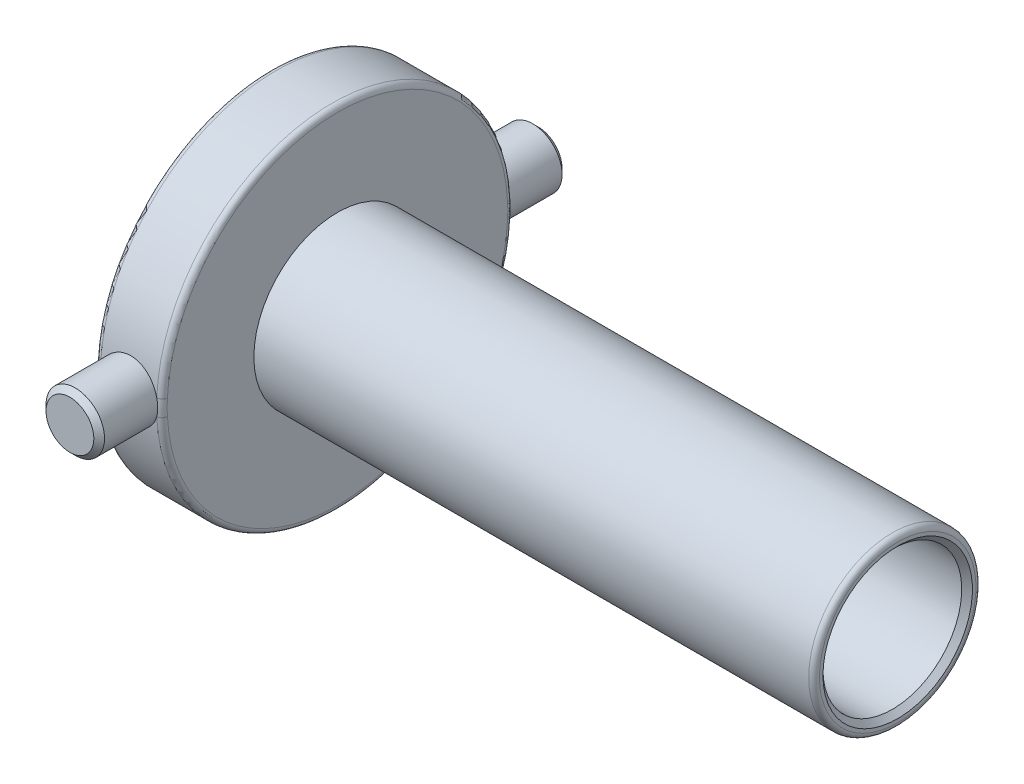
ISO-10303-21;
HEADER;
FILE_DESCRIPTION(('STEP AP214'),'2;1');
FILE_NAME('part.step','',(''),(''),'','','');
FILE_SCHEMA(('AUTOMOTIVE_DESIGN { 1 0 10303 214 1 1 1 1 }'));
ENDSEC;
DATA;
#1=APPLICATION_CONTEXT('core data for automotive mechanical design processes');
#2=APPLICATION_PROTOCOL_DEFINITION('international standard','automotive_design',2000,#1);
#3=PRODUCT_CONTEXT('',#1,'mechanical');
#4=PRODUCT('Part','Part','',(#3));
#5=PRODUCT_RELATED_PRODUCT_CATEGORY('part','',(#4));
#6=PRODUCT_DEFINITION_FORMATION('','',#4);
#7=PRODUCT_DEFINITION_CONTEXT('part definition',#1,'design');
#8=PRODUCT_DEFINITION('design','',#6,#7);
#9=PRODUCT_DEFINITION_SHAPE('','',#8);
#10=(LENGTH_UNIT() NAMED_UNIT(*) SI_UNIT(.MILLI.,.METRE.));
#11=(NAMED_UNIT(*) PLANE_ANGLE_UNIT() SI_UNIT($,.RADIAN.));
#12=(NAMED_UNIT(*) SI_UNIT($,.STERADIAN.) SOLID_ANGLE_UNIT());
#13=UNCERTAINTY_MEASURE_WITH_UNIT(LENGTH_MEASURE(1.E-05),#10,'distance_accuracy_value','');
#14=(GEOMETRIC_REPRESENTATION_CONTEXT(3) GLOBAL_UNCERTAINTY_ASSIGNED_CONTEXT((#13)) GLOBAL_UNIT_ASSIGNED_CONTEXT((#10,
#11,#12)) REPRESENTATION_CONTEXT('',''));
#15=CARTESIAN_POINT('',(0.,0.,0.));
#16=DIRECTION('',(0.,0.,1.));
#17=DIRECTION('',(1.,0.,0.));
#18=AXIS2_PLACEMENT_3D('',#15,#16,#17);
#19=CARTESIAN_POINT('',(0.,0.,0.));
#20=DIRECTION('',(-1.,0.,0.));
#21=DIRECTION('',(0.,0.,1.));
#22=AXIS2_PLACEMENT_3D('',#19,#20,#21);
#23=CYLINDRICAL_SURFACE('',#22,13.335);
#24=CARTESIAN_POINT('',(4.7625,0.,13.335));
#25=CARTESIAN_POINT('',(4.76249503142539,0.123918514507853,13.3349978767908));
#26=CARTESIAN_POINT('',(4.75210112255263,0.247904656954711,13.3332546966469));
#27=CARTESIAN_POINT('',(4.71081739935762,0.492399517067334,13.3264686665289));
#28=CARTESIAN_POINT('',(4.67990873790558,0.61290493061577,13.3214227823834));
#29=CARTESIAN_POINT('',(4.59855466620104,0.84686562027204,13.308597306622));
#30=CARTESIAN_POINT('',(4.54812523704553,0.960326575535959,13.3008199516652));
#31=CARTESIAN_POINT('',(4.42920297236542,1.17716209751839,13.2833866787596));
#32=CARTESIAN_POINT('',(4.36071220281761,1.28053781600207,13.2737309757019));
#33=CARTESIAN_POINT('',(4.20691493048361,1.4752711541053,13.2535081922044));
#34=CARTESIAN_POINT('',(4.12146955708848,1.56651837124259,13.2429340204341));
#35=CARTESIAN_POINT('',(3.93648745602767,1.73345087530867,13.2221203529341));
#36=CARTESIAN_POINT('',(3.83694983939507,1.80913517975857,13.2118808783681));
#37=CARTESIAN_POINT('',(3.62585041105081,1.94323587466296,13.1928272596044));
#38=CARTESIAN_POINT('',(3.51421835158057,2.00154309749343,13.1840222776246));
#39=CARTESIAN_POINT('',(3.28257319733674,2.09853638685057,13.1689329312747));
#40=CARTESIAN_POINT('',(3.16256066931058,2.13722377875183,13.1626483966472));
#41=CARTESIAN_POINT('',(2.91873153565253,2.19353138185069,13.1533820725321));
#42=CARTESIAN_POINT('',(2.79496010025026,2.21134218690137,13.1503704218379));
#43=CARTESIAN_POINT('',(2.54615163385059,2.2259819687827,13.1479005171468));
#44=CARTESIAN_POINT('',(2.42111469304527,2.22281243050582,13.1484420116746));
#45=CARTESIAN_POINT('',(2.17468513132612,2.19573674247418,13.152989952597));
#46=CARTESIAN_POINT('',(2.05326822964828,2.17204470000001,13.1569606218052));
#47=CARTESIAN_POINT('',(1.8161572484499,2.10493254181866,13.1678635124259));
#48=CARTESIAN_POINT('',(1.70046336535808,2.06151174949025,13.1747958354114));
#49=CARTESIAN_POINT('',(1.47744157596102,1.95595757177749,13.1908795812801));
#50=CARTESIAN_POINT('',(1.37015653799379,1.89373527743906,13.2000415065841));
#51=CARTESIAN_POINT('',(1.16746898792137,1.75240748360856,13.2195448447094));
#52=CARTESIAN_POINT('',(1.07206743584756,1.67330062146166,13.2298863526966));
#53=CARTESIAN_POINT('',(0.894615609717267,1.4992826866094,13.2507408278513));
#54=CARTESIAN_POINT('',(0.812745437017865,1.40418791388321,13.2612543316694));
#55=CARTESIAN_POINT('',(0.66609666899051,1.20151483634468,13.2811497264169));
#56=CARTESIAN_POINT('',(0.601318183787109,1.09393645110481,13.2905316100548));
#57=CARTESIAN_POINT('',(0.490675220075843,0.869180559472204,13.307120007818));
#58=CARTESIAN_POINT('',(0.444826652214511,0.751995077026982,13.3143246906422));
#59=CARTESIAN_POINT('',(0.373512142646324,0.511440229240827,13.3257322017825));
#60=CARTESIAN_POINT('',(0.348044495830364,0.388071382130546,13.3299352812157));
#61=CARTESIAN_POINT('',(0.318458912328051,0.140204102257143,13.3348322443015));
#62=CARTESIAN_POINT('',(0.314093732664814,0.0157359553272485,13.3355667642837));
#63=CARTESIAN_POINT('',(0.3261778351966,-0.23215325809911,13.3335551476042));
#64=CARTESIAN_POINT('',(0.34262631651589,-0.355574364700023,13.3308091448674));
#65=CARTESIAN_POINT('',(0.395665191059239,-0.597102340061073,13.3221701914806));
#66=CARTESIAN_POINT('',(0.43213317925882,-0.715236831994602,13.3162963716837));
#67=CARTESIAN_POINT('',(0.524045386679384,-0.943715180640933,13.3020577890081));
#68=CARTESIAN_POINT('',(0.579490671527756,-1.05405859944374,13.2936928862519));
#69=CARTESIAN_POINT('',(0.708349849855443,-1.2648964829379,13.2752993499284));
#70=CARTESIAN_POINT('',(0.781918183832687,-1.36529530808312,13.2652566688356));
#71=CARTESIAN_POINT('',(0.944722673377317,-1.55241054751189,13.244663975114));
#72=CARTESIAN_POINT('',(1.03395996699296,-1.63912596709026,13.234113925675));
#73=CARTESIAN_POINT('',(1.2266781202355,-1.79732933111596,13.2135641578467));
#74=CARTESIAN_POINT('',(1.33029695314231,-1.86865022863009,13.2035712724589));
#75=CARTESIAN_POINT('',(1.54818978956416,-1.99287335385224,13.1853948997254));
#76=CARTESIAN_POINT('',(1.66246345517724,-2.04577616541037,13.1772113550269));
#77=CARTESIAN_POINT('',(1.89795507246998,-2.13141157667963,13.1636315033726));
#78=CARTESIAN_POINT('',(2.0191420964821,-2.16422732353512,13.1582237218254));
#79=CARTESIAN_POINT('',(2.26540579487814,-2.20901871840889,13.1507789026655));
#80=CARTESIAN_POINT('',(2.39048213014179,-2.22099617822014,13.1487415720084));
#81=CARTESIAN_POINT('',(2.63930589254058,-2.22372047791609,13.1482809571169));
#82=CARTESIAN_POINT('',(2.76305043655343,-2.21473026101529,13.1498129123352));
#83=CARTESIAN_POINT('',(3.00723995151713,-2.17634297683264,13.1562201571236));
#84=CARTESIAN_POINT('',(3.12768493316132,-2.14694597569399,13.1610954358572));
#85=CARTESIAN_POINT('',(3.36175465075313,-2.06868032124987,13.1736229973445));
#86=CARTESIAN_POINT('',(3.4753871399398,-2.01983430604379,13.1812720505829));
#87=CARTESIAN_POINT('',(3.69288690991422,-1.90408420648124,13.1984884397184));
#88=CARTESIAN_POINT('',(3.79675370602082,-1.83717922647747,13.2080558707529));
#89=CARTESIAN_POINT('',(3.99310213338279,-1.68627198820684,13.2281729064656));
#90=CARTESIAN_POINT('',(4.08543405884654,-1.60207629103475,13.2387328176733));
#91=CARTESIAN_POINT('',(4.25474907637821,-1.41938542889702,13.2595627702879));
#92=CARTESIAN_POINT('',(4.33172862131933,-1.32088696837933,13.269832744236));
#93=CARTESIAN_POINT('',(4.46863951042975,-1.11157819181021,13.2890078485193));
#94=CARTESIAN_POINT('',(4.52844944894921,-1.00068754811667,13.2979030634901));
#95=CARTESIAN_POINT('',(4.62850057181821,-0.770330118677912,13.3132298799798));
#96=CARTESIAN_POINT('',(4.66876124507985,-0.650872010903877,13.3196639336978));
#97=CARTESIAN_POINT('',(4.7198326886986,-0.442458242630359,13.327939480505));
#98=CARTESIAN_POINT('',(4.73580730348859,-0.354763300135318,13.3305730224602));
#99=CARTESIAN_POINT('',(4.75714265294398,-0.178057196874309,13.3341040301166));
#100=CARTESIAN_POINT('',(4.76250357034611,-0.0890460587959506,13.3350015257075));
#101=CARTESIAN_POINT('',(4.7625,0.,13.335));
#102=B_SPLINE_CURVE_WITH_KNOTS('',3,(#24,#25,#26,#27,#28,#29,#30,#31,#32,#33,#34,#35,#36,#37,
#38,#39,#40,#41,#42,#43,#44,#45,#46,#47,#48,#49,#50,#51,#52,#53,#54,#55,#56,#57,#58,#59,#60,#61,
#62,#63,#64,#65,#66,#67,#68,#69,#70,#71,#72,#73,#74,#75,#76,#77,#78,#79,#80,#81,#82,#83,#84,#85,
#86,#87,#88,#89,#90,#91,#92,#93,#94,#95,#96,#97,#98,#99,#100,#101),.UNSPECIFIED.,.T.,.F.,(4,2,2,
2,2,2,2,2,2,2,2,2,2,2,2,2,2,2,2,2,2,2,2,2,2,2,2,2,2,2,2,2,2,2,2,2,2,2,4),(0.,0.371430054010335,
0.743201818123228,1.11466986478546,1.48609543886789,1.86069914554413,2.23532649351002,
2.61226001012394,2.98916806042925,3.36260762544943,3.73602076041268,4.10558443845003,
4.47516079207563,4.84651290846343,5.21789500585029,5.59387932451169,5.96986606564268,
6.34616818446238,6.72243881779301,7.09429008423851,7.46612704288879,7.83571540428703,
8.20532452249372,8.57819947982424,8.95110153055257,9.32786647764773,9.70461948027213,
10.0798022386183,10.454952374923,10.8254233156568,11.1958930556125,11.5659328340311,
11.9359909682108,12.3104398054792,12.6849750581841,13.062096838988,13.4388418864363,
13.7057507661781,13.9726550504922),.UNSPECIFIED.);
#103=CARTESIAN_POINT('',(0.40639999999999,-0.622300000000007,13.3204717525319));
#104=VERTEX_POINT('',#103);
#105=CARTESIAN_POINT('',(4.6736,-0.622299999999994,13.3204717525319));
#106=VERTEX_POINT('',#105);
#107=EDGE_CURVE('E363',#104,#106,#102,.T.);
#108=ORIENTED_EDGE('',*,*,#107,.F.);
#109=CARTESIAN_POINT('',(0.4064,0.,0.));
#110=DIRECTION('',(1.,0.,0.));
#111=DIRECTION('',(0.,0.,-1.));
#112=AXIS2_PLACEMENT_3D('',#109,#110,#111);
#113=CIRCLE('',#112,13.335);
#114=CARTESIAN_POINT('',(0.406399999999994,-0.622300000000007,-13.3204717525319));
#115=VERTEX_POINT('',#114);
#116=EDGE_CURVE('E400',#104,#115,#113,.T.);
#117=ORIENTED_EDGE('',*,*,#116,.T.);
#118=CARTESIAN_POINT('',(0.317499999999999,0.,-13.335));
#119=CARTESIAN_POINT('',(0.317504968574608,0.123918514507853,-13.3349978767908));
#120=CARTESIAN_POINT('',(0.327898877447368,0.247904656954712,-13.3332546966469));
#121=CARTESIAN_POINT('',(0.369182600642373,0.492399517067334,-13.3264686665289));
#122=CARTESIAN_POINT('',(0.400091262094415,0.61290493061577,-13.3214227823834));
#123=CARTESIAN_POINT('',(0.481445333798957,0.84686562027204,-13.308597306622));
#124=CARTESIAN_POINT('',(0.531874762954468,0.960326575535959,-13.3008199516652));
#125=CARTESIAN_POINT('',(0.650797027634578,1.17716209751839,-13.2833866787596));
#126=CARTESIAN_POINT('',(0.719287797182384,1.28053781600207,-13.2737309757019));
#127=CARTESIAN_POINT('',(0.873085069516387,1.4752711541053,-13.2535081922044));
#128=CARTESIAN_POINT('',(0.958530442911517,1.56651837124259,-13.2429340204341));
#129=CARTESIAN_POINT('',(1.14351254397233,1.73345087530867,-13.2221203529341));
#130=CARTESIAN_POINT('',(1.24305016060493,1.80913517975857,-13.2118808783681));
#131=CARTESIAN_POINT('',(1.45414958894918,1.94323587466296,-13.1928272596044));
#132=CARTESIAN_POINT('',(1.56578164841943,2.00154309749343,-13.1840222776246));
#133=CARTESIAN_POINT('',(1.79742680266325,2.09853638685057,-13.1689329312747));
#134=CARTESIAN_POINT('',(1.91743933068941,2.13722377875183,-13.1626483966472));
#135=CARTESIAN_POINT('',(2.16126846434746,2.19353138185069,-13.1533820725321));
#136=CARTESIAN_POINT('',(2.28503989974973,2.21134218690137,-13.1503704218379));
#137=CARTESIAN_POINT('',(2.5338483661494,2.2259819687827,-13.1479005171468));
#138=CARTESIAN_POINT('',(2.65888530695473,2.22281243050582,-13.1484420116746));
#139=CARTESIAN_POINT('',(2.90531486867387,2.19573674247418,-13.152989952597));
#140=CARTESIAN_POINT('',(3.02673177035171,2.17204470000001,-13.1569606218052));
#141=CARTESIAN_POINT('',(3.2638427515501,2.10493254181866,-13.1678635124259));
#142=CARTESIAN_POINT('',(3.37953663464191,2.06151174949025,-13.1747958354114));
#143=CARTESIAN_POINT('',(3.60255842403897,1.95595757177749,-13.1908795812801));
#144=CARTESIAN_POINT('',(3.70984346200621,1.89373527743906,-13.2000415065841));
#145=CARTESIAN_POINT('',(3.91253101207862,1.75240748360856,-13.2195448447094));
#146=CARTESIAN_POINT('',(4.00793256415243,1.67330062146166,-13.2298863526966));
#147=CARTESIAN_POINT('',(4.18538439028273,1.4992826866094,-13.2507408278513));
#148=CARTESIAN_POINT('',(4.26725456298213,1.40418791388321,-13.2612543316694));
#149=CARTESIAN_POINT('',(4.41390333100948,1.20151483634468,-13.2811497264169));
#150=CARTESIAN_POINT('',(4.47868181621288,1.09393645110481,-13.2905316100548));
#151=CARTESIAN_POINT('',(4.58932477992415,0.869180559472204,-13.307120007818));
#152=CARTESIAN_POINT('',(4.63517334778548,0.751995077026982,-13.3143246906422));
#153=CARTESIAN_POINT('',(4.70648785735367,0.511440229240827,-13.3257322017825));
#154=CARTESIAN_POINT('',(4.73195550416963,0.388071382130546,-13.3299352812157));
#155=CARTESIAN_POINT('',(4.76154108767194,0.140204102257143,-13.3348322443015));
#156=CARTESIAN_POINT('',(4.76590626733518,0.0157359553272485,-13.3355667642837));
#157=CARTESIAN_POINT('',(4.75382216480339,-0.23215325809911,-13.3335551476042));
#158=CARTESIAN_POINT('',(4.7373736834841,-0.355574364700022,-13.3308091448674));
#159=CARTESIAN_POINT('',(4.68433480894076,-0.597102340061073,-13.3221701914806));
#160=CARTESIAN_POINT('',(4.64786682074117,-0.715236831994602,-13.3162963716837));
#161=CARTESIAN_POINT('',(4.55595461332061,-0.943715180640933,-13.3020577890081));
#162=CARTESIAN_POINT('',(4.50050932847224,-1.05405859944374,-13.2936928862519));
#163=CARTESIAN_POINT('',(4.37165015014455,-1.2648964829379,-13.2752993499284));
#164=CARTESIAN_POINT('',(4.29808181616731,-1.36529530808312,-13.2652566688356));
#165=CARTESIAN_POINT('',(4.13527732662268,-1.55241054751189,-13.244663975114));
#166=CARTESIAN_POINT('',(4.04604003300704,-1.63912596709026,-13.234113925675));
#167=CARTESIAN_POINT('',(3.8533218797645,-1.79732933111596,-13.2135641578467));
#168=CARTESIAN_POINT('',(3.74970304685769,-1.86865022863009,-13.2035712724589));
#169=CARTESIAN_POINT('',(3.53181021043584,-1.99287335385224,-13.1853948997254));
#170=CARTESIAN_POINT('',(3.41753654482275,-2.04577616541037,-13.1772113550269));
#171=CARTESIAN_POINT('',(3.18204492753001,-2.13141157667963,-13.1636315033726));
#172=CARTESIAN_POINT('',(3.06085790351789,-2.16422732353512,-13.1582237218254));
#173=CARTESIAN_POINT('',(2.81459420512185,-2.20901871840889,-13.1507789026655));
#174=CARTESIAN_POINT('',(2.6895178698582,-2.22099617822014,-13.1487415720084));
#175=CARTESIAN_POINT('',(2.44069410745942,-2.22372047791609,-13.1482809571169));
#176=CARTESIAN_POINT('',(2.31694956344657,-2.21473026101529,-13.1498129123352));
#177=CARTESIAN_POINT('',(2.07276004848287,-2.17634297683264,-13.1562201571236));
#178=CARTESIAN_POINT('',(1.95231506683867,-2.14694597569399,-13.1610954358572));
#179=CARTESIAN_POINT('',(1.71824534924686,-2.06868032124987,-13.1736229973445));
#180=CARTESIAN_POINT('',(1.60461286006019,-2.01983430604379,-13.1812720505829));
#181=CARTESIAN_POINT('',(1.38711309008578,-1.90408420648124,-13.1984884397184));
#182=CARTESIAN_POINT('',(1.28324629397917,-1.83717922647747,-13.2080558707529));
#183=CARTESIAN_POINT('',(1.0868978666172,-1.68627198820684,-13.2281729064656));
#184=CARTESIAN_POINT('',(0.994565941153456,-1.60207629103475,-13.2387328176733));
#185=CARTESIAN_POINT('',(0.82525092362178,-1.41938542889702,-13.2595627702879));
#186=CARTESIAN_POINT('',(0.748271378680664,-1.32088696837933,-13.269832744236));
#187=CARTESIAN_POINT('',(0.611360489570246,-1.11157819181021,-13.2890078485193));
#188=CARTESIAN_POINT('',(0.551550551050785,-1.00068754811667,-13.2979030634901));
#189=CARTESIAN_POINT('',(0.451499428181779,-0.770330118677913,-13.3132298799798));
#190=CARTESIAN_POINT('',(0.411238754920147,-0.650872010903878,-13.3196639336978));
#191=CARTESIAN_POINT('',(0.360167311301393,-0.442458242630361,-13.327939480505));
#192=CARTESIAN_POINT('',(0.344192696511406,-0.354763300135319,-13.3305730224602));
#193=CARTESIAN_POINT('',(0.322857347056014,-0.17805719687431,-13.3341040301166));
#194=CARTESIAN_POINT('',(0.317496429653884,-0.0890460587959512,-13.3350015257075));
#195=CARTESIAN_POINT('',(0.317499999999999,0.,-13.335));
#196=B_SPLINE_CURVE_WITH_KNOTS('',3,(#118,#119,#120,#121,#122,#123,#124,#125,#126,#127,#128,
#129,#130,#131,#132,#133,#134,#135,#136,#137,#138,#139,#140,#141,#142,#143,#144,#145,#146,#147,
#148,#149,#150,#151,#152,#153,#154,#155,#156,#157,#158,#159,#160,#161,#162,#163,#164,#165,#166,
#167,#168,#169,#170,#171,#172,#173,#174,#175,#176,#177,#178,#179,#180,#181,#182,#183,#184,#185,
#186,#187,#188,#189,#190,#191,#192,#193,#194,#195),.UNSPECIFIED.,.T.,.F.,(4,2,2,2,2,2,2,2,2,2,2,
2,2,2,2,2,2,2,2,2,2,2,2,2,2,2,2,2,2,2,2,2,2,2,2,2,2,2,4),(0.,0.371430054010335,
0.743201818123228,1.11466986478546,1.48609543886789,1.86069914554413,2.23532649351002,
2.61226001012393,2.98916806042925,3.36260762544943,3.73602076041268,4.10558443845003,
4.47516079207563,4.84651290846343,5.21789500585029,5.59387932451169,5.96986606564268,
6.34616818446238,6.72243881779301,7.09429008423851,7.46612704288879,7.83571540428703,
8.20532452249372,8.57819947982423,8.95110153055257,9.32786647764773,9.70461948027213,
10.0798022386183,10.454952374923,10.8254233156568,11.1958930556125,11.5659328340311,
11.9359909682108,12.3104398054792,12.6849750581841,13.062096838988,13.4388418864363,
13.7057507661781,13.9726550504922),.UNSPECIFIED.);
#197=CARTESIAN_POINT('',(4.67360000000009,-0.622300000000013,-13.3204717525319));
#198=VERTEX_POINT('',#197);
#199=EDGE_CURVE('E372',#198,#115,#196,.T.);
#200=ORIENTED_EDGE('',*,*,#199,.F.);
#201=CARTESIAN_POINT('',(4.6736,0.,0.));
#202=DIRECTION('',(-1.,0.,0.));
#203=DIRECTION('',(0.,0.,1.));
#204=AXIS2_PLACEMENT_3D('',#201,#202,#203);
#205=CIRCLE('',#204,13.335);
#206=EDGE_CURVE('E409',#198,#106,#205,.T.);
#207=ORIENTED_EDGE('',*,*,#206,.T.);
#208=EDGE_LOOP('',(#108,#117,#200,#207));
#209=FACE_BOUND('',#208,.T.);
#210=ADVANCED_FACE('F33',(#209),#23,.T.);
#211=CARTESIAN_POINT('',(0.406399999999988,0.622300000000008,-13.3204717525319));
#212=VERTEX_POINT('',#211);
#213=CARTESIAN_POINT('',(4.6736,0.622299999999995,-13.3204717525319));
#214=VERTEX_POINT('',#213);
#215=EDGE_CURVE('E273',#212,#214,#196,.T.);
#216=ORIENTED_EDGE('',*,*,#215,.F.);
#217=CARTESIAN_POINT('',(0.4064,0.,0.));
#218=DIRECTION('',(1.,0.,0.));
#219=DIRECTION('',(0.,0.,-1.));
#220=AXIS2_PLACEMENT_3D('',#217,#218,#219);
#221=CIRCLE('',#220,13.335);
#222=CARTESIAN_POINT('',(0.406399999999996,0.622300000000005,13.3204717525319));
#223=VERTEX_POINT('',#222);
#224=EDGE_CURVE('E328',#212,#223,#221,.T.);
#225=ORIENTED_EDGE('',*,*,#224,.T.);
#226=CARTESIAN_POINT('',(4.67360000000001,0.622299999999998,13.3204717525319));
#227=VERTEX_POINT('',#226);
#228=EDGE_CURVE('E280',#227,#223,#102,.T.);
#229=ORIENTED_EDGE('',*,*,#228,.F.);
#230=CARTESIAN_POINT('',(4.6736,0.,0.));
#231=DIRECTION('',(-1.,0.,0.));
#232=DIRECTION('',(0.,0.,1.));
#233=AXIS2_PLACEMENT_3D('',#230,#231,#232);
#234=CIRCLE('',#233,13.335);
#235=EDGE_CURVE('E407',#227,#214,#234,.T.);
#236=ORIENTED_EDGE('',*,*,#235,.T.);
#237=EDGE_LOOP('',(#216,#225,#229,#236));
#238=FACE_BOUND('',#237,.T.);
#239=ADVANCED_FACE('F262',(#238),#23,.T.);
#240=CARTESIAN_POINT('',(5.08,5.2705,0.));
#241=DIRECTION('',(-1.,0.,0.));
#242=DIRECTION('',(0.,0.,1.));
#243=AXIS2_PLACEMENT_3D('',#240,#241,#242);
#244=PLANE('',#243);
#245=CARTESIAN_POINT('',(5.08,0.,0.));
#246=DIRECTION('',(-1.,0.,0.));
#247=DIRECTION('',(0.,0.,1.));
#248=AXIS2_PLACEMENT_3D('',#245,#246,#247);
#249=CIRCLE('',#248,5.2705);
#250=CARTESIAN_POINT('',(5.08,0.,5.2705));
#251=VERTEX_POINT('',#250);
#252=EDGE_CURVE('E116',#251,#251,#249,.T.);
#253=ORIENTED_EDGE('',*,*,#252,.F.);
#254=EDGE_LOOP('',(#253));
#255=FACE_BOUND('',#254,.T.);
#256=ADVANCED_FACE('F141',(#255),#244,.F.);
#257=CARTESIAN_POINT('',(0.,13.335,0.));
#258=DIRECTION('',(1.,0.,0.));
#259=DIRECTION('',(0.,0.,-1.));
#260=AXIS2_PLACEMENT_3D('',#257,#258,#259);
#261=PLANE('',#260);
#262=CARTESIAN_POINT('',(0.,0.,0.));
#263=DIRECTION('',(1.,0.,0.));
#264=DIRECTION('',(0.,0.,-1.));
#265=AXIS2_PLACEMENT_3D('',#262,#263,#264);
#266=CIRCLE('',#265,12.9286);
#267=CARTESIAN_POINT('',(0.,-0.60333466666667,-12.914514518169));
#268=VERTEX_POINT('',#267);
#269=CARTESIAN_POINT('',(0.,-0.60333466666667,12.914514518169));
#270=VERTEX_POINT('',#269);
#271=EDGE_CURVE('E101',#268,#270,#266,.F.);
#272=ORIENTED_EDGE('',*,*,#271,.T.);
#273=CARTESIAN_POINT('',(0.57380625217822,-1.03613802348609,13.2946839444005));
#274=CARTESIAN_POINT('',(0.,-0.994294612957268,13.550681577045));
#275=CARTESIAN_POINT('',(0.,-1.09587478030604,12.9292149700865));
#276=CARTESIAN_POINT('',(0.560125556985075,-1.01018498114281,13.2967060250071));
#277=CARTESIAN_POINT('',(0.,-0.98138512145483,13.5232940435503));
#278=CARTESIAN_POINT('',(0.,-1.05998212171,12.9233827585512));
#279=CARTESIAN_POINT('',(0.546521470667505,-0.983113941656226,13.298739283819));
#280=CARTESIAN_POINT('',(0.,-0.962879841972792,13.4980641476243));
#281=CARTESIAN_POINT('',(0.,-1.02389285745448,12.9190975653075));
#282=CARTESIAN_POINT('',(0.519799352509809,-0.926957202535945,13.3027719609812));
#283=CARTESIAN_POINT('',(0.,-0.918605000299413,13.4533192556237));
#284=CARTESIAN_POINT('',(0.,-0.951574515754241,12.9129370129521));
#285=CARTESIAN_POINT('',(0.506680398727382,-0.89787566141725,13.3047714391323));
#286=CARTESIAN_POINT('',(0.,-0.8930774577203,13.433428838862));
#287=CARTESIAN_POINT('',(0.,-0.915345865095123,12.9110568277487));
#288=CARTESIAN_POINT('',(0.481256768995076,-0.837938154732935,13.3086807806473));
#289=CARTESIAN_POINT('',(0.,-0.837650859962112,13.3986247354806));
#290=CARTESIAN_POINT('',(0.,-0.843006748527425,12.9090084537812));
#291=CARTESIAN_POINT('',(0.468948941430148,-0.80709004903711,13.3105909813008));
#292=CARTESIAN_POINT('',(0.,-0.807819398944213,13.383427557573));
#293=CARTESIAN_POINT('',(0.,-0.80689641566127,12.9088331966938));
#294=CARTESIAN_POINT('',(0.445336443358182,-0.743653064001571,13.314284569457));
#295=CARTESIAN_POINT('',(0.,-0.745270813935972,13.3569373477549));
#296=CARTESIAN_POINT('',(0.,-0.734672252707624,12.9096551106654));
#297=CARTESIAN_POINT('',(0.434032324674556,-0.71106324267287,13.3160678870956));
#298=CARTESIAN_POINT('',(0.,-0.712507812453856,13.3454626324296));
#299=CARTESIAN_POINT('',(0.,-0.698558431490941,12.9106529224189));
#300=CARTESIAN_POINT('',(0.402015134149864,-0.611043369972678,13.321156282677));
#301=CARTESIAN_POINT('',(0.,-0.612872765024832,13.3161813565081));
#302=CARTESIAN_POINT('',(0.,-0.590407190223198,12.9147038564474));
#303=CARTESIAN_POINT('',(0.383145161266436,-0.541243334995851,13.3242078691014));
#304=CARTESIAN_POINT('',(0.,-0.541281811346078,13.3019439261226));
#305=CARTESIAN_POINT('',(0.,-0.518416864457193,12.9188142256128));
#306=CARTESIAN_POINT('',(0.351951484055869,-0.396754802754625,13.329292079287));
#307=CARTESIAN_POINT('',(0.,-0.395328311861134,13.2814273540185));
#308=CARTESIAN_POINT('',(0.,-0.374376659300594,12.926872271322));
#309=CARTESIAN_POINT('',(0.339632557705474,-0.322062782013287,13.3313239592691));
#310=CARTESIAN_POINT('',(0.,-0.31988744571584,13.2747186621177));
#311=CARTESIAN_POINT('',(0.,-0.302326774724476,12.9308198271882));
#312=CARTESIAN_POINT('',(0.325336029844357,-0.193729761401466,13.3336935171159));
#313=CARTESIAN_POINT('',(0.,-0.191847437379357,13.2674590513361));
#314=CARTESIAN_POINT('',(0.,-0.180719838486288,12.9356247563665));
#315=CARTESIAN_POINT('',(0.321327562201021,-0.14082615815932,13.3343625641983));
#316=CARTESIAN_POINT('',(0.,-0.13925646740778,13.2655874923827));
#317=CARTESIAN_POINT('',(0.,-0.131188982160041,12.9370628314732));
#318=CARTESIAN_POINT('',(0.317134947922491,-0.0345655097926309,13.3350604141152));
#319=CARTESIAN_POINT('',(0.,-0.0342234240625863,13.2636488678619));
#320=CARTESIAN_POINT('',(0.,-0.0321146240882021,12.9385691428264));
#321=CARTESIAN_POINT('',(0.316950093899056,0.0187914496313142,13.3350893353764));
#322=CARTESIAN_POINT('',(0.,0.0186254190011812,13.2635663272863));
#323=CARTESIAN_POINT('',(0.,0.0174288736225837,12.9386376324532));
#324=CARTESIAN_POINT('',(0.320393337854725,0.125088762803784,13.3345155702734));
#325=CARTESIAN_POINT('',(0.,0.123667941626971,13.2651490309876));
#326=CARTESIAN_POINT('',(0.,0.116482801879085,12.9373934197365));
#327=CARTESIAN_POINT('',(0.324020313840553,0.178029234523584,13.3339130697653));
#328=CARTESIAN_POINT('',(0.,0.176266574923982,13.2668260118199));
#329=CARTESIAN_POINT('',(0.,0.165993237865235,12.9360811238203));
#330=CARTESIAN_POINT('',(0.334927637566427,0.282728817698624,13.3321053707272));
#331=CARTESIAN_POINT('',(0.,0.280337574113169,13.272285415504));
#332=CARTESIAN_POINT('',(0.,0.264976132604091,12.9323873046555));
#333=CARTESIAN_POINT('',(0.342208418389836,0.334487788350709,13.3309001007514));
#334=CARTESIAN_POINT('',(0.,0.332204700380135,13.276113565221));
#335=CARTESIAN_POINT('',(0.,0.314448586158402,12.9300056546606));
#336=CARTESIAN_POINT('',(0.362629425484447,0.450474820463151,13.327545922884));
#337=CARTESIAN_POINT('',(0.,0.449021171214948,13.2881417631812));
#338=CARTESIAN_POINT('',(0.,0.427432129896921,12.9239935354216));
#339=CARTESIAN_POINT('',(0.376847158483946,0.514062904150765,13.325226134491));
#340=CARTESIAN_POINT('',(0.,0.513778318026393,13.2974212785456));
#341=CARTESIAN_POINT('',(0.,0.490934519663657,12.9202005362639));
#342=CARTESIAN_POINT('',(0.409759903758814,0.636940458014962,13.3199239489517));
#343=CARTESIAN_POINT('',(0.,0.638357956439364,13.3229009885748));
#344=CARTESIAN_POINT('',(0.,0.61801785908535,12.9136607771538));
#345=CARTESIAN_POINT('',(0.428457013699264,0.696227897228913,13.3169412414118));
#346=CARTESIAN_POINT('',(0.,0.698821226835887,13.3395614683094));
#347=CARTESIAN_POINT('',(0.,0.681598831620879,12.9109145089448));
#348=CARTESIAN_POINT('',(0.448888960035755,0.752810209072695,13.3137309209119));
#349=CARTESIAN_POINT('',(0.,0.753692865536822,13.3609143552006));
#350=CARTESIAN_POINT('',(0.,0.745250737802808,12.9096305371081));
#351=(BOUNDED_SURFACE() B_SPLINE_SURFACE(3,2,((#273,#274,#275),(#276,#277,#278),(#279,#280,
#281),(#282,#283,#284),(#285,#286,#287),(#288,#289,#290),(#291,#292,#293),(#294,#295,#296),
(#297,#298,#299),(#300,#301,#302),(#303,#304,#305),(#306,#307,#308),(#309,#310,#311),(#312,#313,
#314),(#315,#316,#317),(#318,#319,#320),(#321,#322,#323),(#324,#325,#326),(#327,#328,#329),
(#330,#331,#332),(#333,#334,#335),(#336,#337,#338),(#339,#340,#341),(#342,#343,#344),(#345,#346,
#347),(#348,#349,#350)),.UNSPECIFIED.,.F.,.F.,.F.) B_SPLINE_SURFACE_WITH_KNOTS((4,2,2,2,2,2,2,2,
2,2,2,2,4),(3,3),(0.,0.108979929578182,0.217740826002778,0.326050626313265,0.434419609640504,
0.65072864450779,0.867195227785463,1.01583320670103,1.16444368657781,1.31301043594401,
1.4615947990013,1.65243434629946,1.8433634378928),(0.,1.),
.UNSPECIFIED.) GEOMETRIC_REPRESENTATION_ITEM() RATIONAL_B_SPLINE_SURFACE(((1.,0.542252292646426,
1.),(1.,0.557766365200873,1.),(1.,0.572539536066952,1.),(1.,0.600567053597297,1.),(1.,
0.61382439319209,1.),(1.,0.638793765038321,1.),(1.,0.650511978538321,1.),(1.,0.672470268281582,
1.),(1.,0.682709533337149,1.),(1.,0.711165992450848,1.),(1.,0.727171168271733,1.),(1.,
0.753098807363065,1.),(1.,0.763016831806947,1.),(1.,0.774438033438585,1.),(1.,0.777604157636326,
1.),(1.,0.780914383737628,1.),(1.,0.781059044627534,1.),(1.,0.778342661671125,1.),(1.,
0.775482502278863,1.),(1.,0.766779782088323,1.),(1.,0.760936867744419,1.),(1.,0.744275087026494,
1.),(1.,0.732513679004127,1.),(1.,0.704306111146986,1.),(1.,0.687857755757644,1.),(1.,
0.669122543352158,1.))) REPRESENTATION_ITEM('') SURFACE());
#352=CARTESIAN_POINT('',(0.,-1.09587478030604,12.9292149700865));
#353=CARTESIAN_POINT('',(0.,-1.05998212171,12.9233827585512));
#354=CARTESIAN_POINT('',(0.,-1.02389285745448,12.9190975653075));
#355=CARTESIAN_POINT('',(0.,-0.951574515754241,12.9129370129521));
#356=CARTESIAN_POINT('',(0.,-0.915345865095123,12.9110568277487));
#357=CARTESIAN_POINT('',(0.,-0.843006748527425,12.9090084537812));
#358=CARTESIAN_POINT('',(0.,-0.80689641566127,12.9088331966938));
#359=CARTESIAN_POINT('',(0.,-0.734672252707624,12.9096551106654));
#360=CARTESIAN_POINT('',(0.,-0.698558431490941,12.9106529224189));
#361=CARTESIAN_POINT('',(0.,-0.590407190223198,12.9147038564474));
#362=CARTESIAN_POINT('',(0.,-0.518416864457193,12.9188142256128));
#363=CARTESIAN_POINT('',(0.,-0.374376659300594,12.926872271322));
#364=CARTESIAN_POINT('',(0.,-0.302326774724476,12.9308198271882));
#365=CARTESIAN_POINT('',(0.,-0.180719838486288,12.9356247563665));
#366=CARTESIAN_POINT('',(0.,-0.131188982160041,12.9370628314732));
#367=CARTESIAN_POINT('',(0.,-0.0321146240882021,12.9385691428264));
#368=CARTESIAN_POINT('',(0.,0.0174288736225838,12.9386376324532));
#369=CARTESIAN_POINT('',(0.,0.116482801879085,12.9373934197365));
#370=CARTESIAN_POINT('',(0.,0.165993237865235,12.9360811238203));
#371=CARTESIAN_POINT('',(0.,0.264976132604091,12.9323873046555));
#372=CARTESIAN_POINT('',(0.,0.314448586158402,12.9300056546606));
#373=CARTESIAN_POINT('',(0.,0.427432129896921,12.9239935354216));
#374=CARTESIAN_POINT('',(0.,0.490934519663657,12.9202005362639));
#375=CARTESIAN_POINT('',(0.,0.61801785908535,12.9136607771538));
#376=CARTESIAN_POINT('',(0.,0.681598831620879,12.9109145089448));
#377=CARTESIAN_POINT('',(0.,0.745250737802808,12.9096305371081));
#378=B_SPLINE_CURVE_WITH_KNOTS('',3,(#352,#353,#354,#355,#356,#357,#358,#359,#360,#361,#362,
#363,#364,#365,#366,#367,#368,#369,#370,#371,#372,#373,#374,#375,#376,#377),.UNSPECIFIED.,.F.,
.F.,(4,2,2,2,2,2,2,2,2,2,2,2,4),(0.,0.108979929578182,0.217740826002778,0.326050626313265,
0.434419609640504,0.65072864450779,0.867195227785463,1.01583320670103,1.16444368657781,
1.31301043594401,1.4615947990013,1.65243434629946,1.8433634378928),.UNSPECIFIED.);
#379=CARTESIAN_POINT('',(0.,0.60333466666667,12.914514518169));
#380=VERTEX_POINT('',#379);
#381=EDGE_CURVE('E410',#270,#380,#378,.T.);
#382=ORIENTED_EDGE('',*,*,#381,.T.);
#383=CARTESIAN_POINT('',(0.,0.,0.));
#384=DIRECTION('',(1.,0.,0.));
#385=DIRECTION('',(0.,0.,-1.));
#386=AXIS2_PLACEMENT_3D('',#383,#384,#385);
#387=CIRCLE('',#386,12.9286);
#388=CARTESIAN_POINT('',(0.,0.60333466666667,-12.914514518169));
#389=VERTEX_POINT('',#388);
#390=EDGE_CURVE('E104',#380,#389,#387,.F.);
#391=ORIENTED_EDGE('',*,*,#390,.T.);
#392=CARTESIAN_POINT('',(0.573806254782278,1.03613802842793,-13.2946839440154));
#393=CARTESIAN_POINT('',(0.,0.994294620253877,-13.5506815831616));
#394=CARTESIAN_POINT('',(0.,1.09587478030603,-12.9292149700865));
#395=CARTESIAN_POINT('',(0.560125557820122,1.01018498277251,-13.2967060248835));
#396=CARTESIAN_POINT('',(0.,0.981385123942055,-13.5232940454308));
#397=CARTESIAN_POINT('',(0.,1.05998212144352,-12.9233827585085));
#398=CARTESIAN_POINT('',(0.546521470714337,0.983113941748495,-13.2987392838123));
#399=CARTESIAN_POINT('',(0.,0.962879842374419,-13.4980641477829));
#400=CARTESIAN_POINT('',(0.,1.02389285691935,-12.9190975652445));
#401=CARTESIAN_POINT('',(0.519799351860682,0.926957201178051,-13.3027719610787));
#402=CARTESIAN_POINT('',(0.,0.918604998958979,-13.4533192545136));
#403=CARTESIAN_POINT('',(0.,0.951574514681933,-12.9129370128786));
#404=CARTESIAN_POINT('',(0.506680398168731,0.897875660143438,-13.3047714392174));
#405=CARTESIAN_POINT('',(0.,0.893077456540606,-13.4334288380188));
#406=CARTESIAN_POINT('',(0.,0.915345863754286,-12.9110568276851));
#407=CARTESIAN_POINT('',(0.481256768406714,0.83793815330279,-13.3086807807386));
#408=CARTESIAN_POINT('',(0.,0.837650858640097,-13.3986247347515));
#409=CARTESIAN_POINT('',(0.,0.843006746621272,-12.9090084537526));
#410=CARTESIAN_POINT('',(0.468948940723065,0.807090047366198,-13.3105909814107));
#411=CARTESIAN_POINT('',(0.,0.80781939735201,-13.3834275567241));
#412=CARTESIAN_POINT('',(0.,0.806896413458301,-12.9088331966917));
#413=CARTESIAN_POINT('',(0.445336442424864,0.743653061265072,-13.3142845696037));
#414=CARTESIAN_POINT('',(0.,0.745270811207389,-13.3569373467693));
#415=CARTESIAN_POINT('',(0.,0.734672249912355,-12.9096551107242));
#416=CARTESIAN_POINT('',(0.434032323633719,0.711063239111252,-13.3160678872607));
#417=CARTESIAN_POINT('',(0.,0.712507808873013,-13.3454626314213));
#418=CARTESIAN_POINT('',(0.,0.69855842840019,-12.9106529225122));
#419=CARTESIAN_POINT('',(0.402015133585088,0.611043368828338,-13.3211562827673));
#420=CARTESIAN_POINT('',(0.,0.612872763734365,-13.3161813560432));
#421=CARTESIAN_POINT('',(0.,0.590407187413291,-12.914703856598));
#422=CARTESIAN_POINT('',(0.383145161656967,0.541243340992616,-13.3242078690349));
#423=CARTESIAN_POINT('',(0.,0.541281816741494,-13.3019439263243));
#424=CARTESIAN_POINT('',(0.,0.518416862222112,-12.9188142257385));
#425=CARTESIAN_POINT('',(0.351951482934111,0.396754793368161,-13.3292920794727));
#426=CARTESIAN_POINT('',(0.,0.395328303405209,-13.2814273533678));
#427=CARTESIAN_POINT('',(0.,0.374376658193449,-12.9268722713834));
#428=CARTESIAN_POINT('',(0.339632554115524,0.322062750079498,-13.3313239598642));
#429=CARTESIAN_POINT('',(0.,0.319887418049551,-13.274718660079));
#430=CARTESIAN_POINT('',(0.,0.302326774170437,-12.9308198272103));
#431=CARTESIAN_POINT('',(0.325336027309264,0.193729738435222,-13.3336935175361));
#432=CARTESIAN_POINT('',(0.,0.191847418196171,-13.2674590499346));
#433=CARTESIAN_POINT('',(0.,0.180719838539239,-12.9356247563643));
#434=CARTESIAN_POINT('',(0.321327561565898,0.140826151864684,-13.3343625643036));
#435=CARTESIAN_POINT('',(0.,0.139256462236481,-13.2655874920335));
#436=CARTESIAN_POINT('',(0.,0.131188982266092,-12.9370628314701));
#437=CARTESIAN_POINT('',(0.317134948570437,0.0345655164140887,-13.3350604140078));
#438=CARTESIAN_POINT('',(0.,0.0342234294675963,-13.2636488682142));
#439=CARTESIAN_POINT('',(0.,0.0321146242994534,-12.9385691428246));
#440=CARTESIAN_POINT('',(0.31695009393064,-0.0187914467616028,-13.3350893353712));
#441=CARTESIAN_POINT('',(0.,-0.0186254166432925,-13.2635663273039));
#442=CARTESIAN_POINT('',(0.,-0.0174288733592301,-12.9386376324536));
#443=CARTESIAN_POINT('',(0.320393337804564,-0.125088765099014,-13.3345155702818));
#444=CARTESIAN_POINT('',(0.,-0.123667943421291,-13.2651490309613));
#445=CARTESIAN_POINT('',(0.,-0.116482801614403,-12.9373934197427));
#446=CARTESIAN_POINT('',(0.324020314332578,-0.178029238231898,-13.3339130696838));
#447=CARTESIAN_POINT('',(0.,-0.176266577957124,-13.2668260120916));
#448=CARTESIAN_POINT('',(0.,-0.16599323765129,-12.9360811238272));
#449=CARTESIAN_POINT('',(0.334927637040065,-0.282728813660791,-13.3321053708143));
#450=CARTESIAN_POINT('',(0.,-0.280337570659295,-13.2722854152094));
#451=CARTESIAN_POINT('',(0.,-0.264976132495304,-12.9323873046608));
#452=CARTESIAN_POINT('',(0.342208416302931,-0.334487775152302,-13.330900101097));
#453=CARTESIAN_POINT('',(0.,-0.33220468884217,-13.2761135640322));
#454=CARTESIAN_POINT('',(0.,-0.314448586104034,-12.9300056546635));
#455=CARTESIAN_POINT('',(0.362629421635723,-0.450474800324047,-13.3275459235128));
#456=CARTESIAN_POINT('',(0.,-0.449021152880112,-13.288141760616));
#457=CARTESIAN_POINT('',(0.,-0.427432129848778,-12.9239935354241));
#458=CARTESIAN_POINT('',(0.376847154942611,-0.514062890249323,-13.3252261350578));
#459=CARTESIAN_POINT('',(0.,-0.513778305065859,-13.2974212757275));
#460=CARTESIAN_POINT('',(0.,-0.490934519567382,-12.9202005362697));
#461=CARTESIAN_POINT('',(0.409759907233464,-0.636940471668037,-13.3199239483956));
#462=CARTESIAN_POINT('',(0.,-0.638357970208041,-13.3229009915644));
#463=CARTESIAN_POINT('',(0.,-0.618017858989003,-12.913660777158));
#464=CARTESIAN_POINT('',(0.428457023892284,-0.696227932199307,-13.3169412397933));
#465=CARTESIAN_POINT('',(0.,-0.698821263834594,-13.3395614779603));
#466=CARTESIAN_POINT('',(0.,-0.681598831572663,-12.9109145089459));
#467=CARTESIAN_POINT('',(0.448888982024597,-0.752810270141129,-13.3137309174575));
#468=CARTESIAN_POINT('',(0.,-0.753692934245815,-13.3609143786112));
#469=CARTESIAN_POINT('',(0.,-0.745250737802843,-12.9096305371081));
#470=(BOUNDED_SURFACE() B_SPLINE_SURFACE(3,2,((#392,#393,#394),(#395,#396,#397),(#398,#399,
#400),(#401,#402,#403),(#404,#405,#406),(#407,#408,#409),(#410,#411,#412),(#413,#414,#415),
(#416,#417,#418),(#419,#420,#421),(#422,#423,#424),(#425,#426,#427),(#428,#429,#430),(#431,#432,
#433),(#434,#435,#436),(#437,#438,#439),(#440,#441,#442),(#443,#444,#445),(#446,#447,#448),
(#449,#450,#451),(#452,#453,#454),(#455,#456,#457),(#458,#459,#460),(#461,#462,#463),(#464,#465,
#466),(#467,#468,#469)),.UNSPECIFIED.,.F.,.F.,.F.) B_SPLINE_SURFACE_WITH_KNOTS((4,2,2,2,2,2,2,2,
2,2,2,2,4),(3,3),(0.,0.108979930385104,0.217740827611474,0.326050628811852,0.434419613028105,
0.650728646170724,0.867195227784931,1.01583320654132,1.16444368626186,1.31301043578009,
1.46159479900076,1.65243434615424,1.84336343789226),(0.,1.),
.UNSPECIFIED.) GEOMETRIC_REPRESENTATION_ITEM() RATIONAL_B_SPLINE_SURFACE(((1.,0.542252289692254,
1.),(1.,0.557766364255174,1.),(1.,0.572539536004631,1.),(1.,0.600567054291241,1.),(1.,
0.613824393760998,1.),(1.,0.638793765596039,1.),(1.,0.650511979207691,1.),(1.,0.672470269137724,
1.),(1.,0.682709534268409,1.),(1.,0.711165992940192,1.),(1.,0.727171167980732,1.),(1.,
0.753098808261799,1.),(1.,0.763016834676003,1.),(1.,0.774438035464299,1.),(1.,0.777604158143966,
1.),(1.,0.780914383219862,1.),(1.,0.781059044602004,1.),(1.,0.778342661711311,1.),(1.,
0.775482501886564,1.),(1.,0.766779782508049,1.),(1.,0.760936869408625,1.),(1.,0.744275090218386,
1.),(1.,0.732513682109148,1.),(1.,0.704306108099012,1.),(1.,0.687857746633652,1.),(1.,
0.669122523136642,1.))) REPRESENTATION_ITEM('') SURFACE());
#471=CARTESIAN_POINT('',(0.,1.09587478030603,-12.9292149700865));
#472=CARTESIAN_POINT('',(0.,1.05998212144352,-12.9233827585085));
#473=CARTESIAN_POINT('',(0.,1.02389285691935,-12.9190975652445));
#474=CARTESIAN_POINT('',(0.,0.951574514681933,-12.9129370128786));
#475=CARTESIAN_POINT('',(0.,0.915345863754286,-12.9110568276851));
#476=CARTESIAN_POINT('',(0.,0.843006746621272,-12.9090084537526));
#477=CARTESIAN_POINT('',(0.,0.806896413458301,-12.9088331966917));
#478=CARTESIAN_POINT('',(0.,0.734672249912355,-12.9096551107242));
#479=CARTESIAN_POINT('',(0.,0.69855842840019,-12.9106529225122));
#480=CARTESIAN_POINT('',(0.,0.590407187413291,-12.914703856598));
#481=CARTESIAN_POINT('',(0.,0.518416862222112,-12.9188142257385));
#482=CARTESIAN_POINT('',(0.,0.374376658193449,-12.9268722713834));
#483=CARTESIAN_POINT('',(0.,0.302326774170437,-12.9308198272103));
#484=CARTESIAN_POINT('',(0.,0.180719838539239,-12.9356247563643));
#485=CARTESIAN_POINT('',(0.,0.131188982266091,-12.9370628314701));
#486=CARTESIAN_POINT('',(0.,0.0321146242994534,-12.9385691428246));
#487=CARTESIAN_POINT('',(0.,-0.0174288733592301,-12.9386376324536));
#488=CARTESIAN_POINT('',(0.,-0.116482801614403,-12.9373934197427));
#489=CARTESIAN_POINT('',(0.,-0.16599323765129,-12.9360811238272));
#490=CARTESIAN_POINT('',(0.,-0.264976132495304,-12.9323873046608));
#491=CARTESIAN_POINT('',(0.,-0.314448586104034,-12.9300056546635));
#492=CARTESIAN_POINT('',(0.,-0.427432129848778,-12.9239935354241));
#493=CARTESIAN_POINT('',(0.,-0.490934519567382,-12.9202005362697));
#494=CARTESIAN_POINT('',(0.,-0.618017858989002,-12.913660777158));
#495=CARTESIAN_POINT('',(0.,-0.681598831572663,-12.9109145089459));
#496=CARTESIAN_POINT('',(0.,-0.745250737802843,-12.9096305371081));
#497=B_SPLINE_CURVE_WITH_KNOTS('',3,(#471,#472,#473,#474,#475,#476,#477,#478,#479,#480,#481,
#482,#483,#484,#485,#486,#487,#488,#489,#490,#491,#492,#493,#494,#495,#496),.UNSPECIFIED.,.F.,
.F.,(4,2,2,2,2,2,2,2,2,2,2,2,4),(0.,0.108979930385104,0.217740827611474,0.326050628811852,
0.434419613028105,0.650728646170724,0.867195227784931,1.01583320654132,1.16444368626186,
1.31301043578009,1.46159479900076,1.65243434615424,1.84336343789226),.UNSPECIFIED.);
#498=EDGE_CURVE('E96',#389,#268,#497,.T.);
#499=ORIENTED_EDGE('',*,*,#498,.T.);
#500=EDGE_LOOP('',(#272,#382,#391,#499));
#501=FACE_BOUND('',#500,.T.);
#502=ADVANCED_FACE('F98',(#501),#261,.F.);
#503=CARTESIAN_POINT('',(5.08,6.34999999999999,0.));
#504=DIRECTION('',(-1.,0.,0.));
#505=DIRECTION('',(0.,0.,1.));
#506=AXIS2_PLACEMENT_3D('',#503,#504,#505);
#507=PLANE('',#506);
#508=CARTESIAN_POINT('',(5.08,-1.09587478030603,12.9292149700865));
#509=CARTESIAN_POINT('',(5.08,-0.994300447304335,13.5506792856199));
#510=CARTESIAN_POINT('',(4.50619560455,-1.03614107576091,13.2946849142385));
#511=CARTESIAN_POINT('',(5.08,-1.05998181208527,12.923380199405));
#512=CARTESIAN_POINT('',(5.08,-0.981405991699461,13.5233008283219));
#513=CARTESIAN_POINT('',(4.51987709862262,-1.01019089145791,13.2967082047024));
#514=CARTESIAN_POINT('',(5.08,-1.02389236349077,12.9190967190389));
#515=CARTESIAN_POINT('',(5.08,-0.962890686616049,13.498067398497));
#516=CARTESIAN_POINT('',(4.5334802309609,-0.983117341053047,13.2987408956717));
#517=CARTESIAN_POINT('',(5.08,-0.95157406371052,12.9129390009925));
#518=CARTESIAN_POINT('',(5.08,-0.918595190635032,13.4533173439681));
#519=CARTESIAN_POINT('',(4.56019887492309,-0.926954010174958,13.3027715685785));
#520=CARTESIAN_POINT('',(5.08,-0.915345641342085,12.9110599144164));
#521=CARTESIAN_POINT('',(5.08,-0.893056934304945,13.4334251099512));
#522=CARTESIAN_POINT('',(4.57331531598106,-0.897868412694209,13.3047696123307));
#523=CARTESIAN_POINT('',(5.08,-0.806902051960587,12.9079778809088));
#524=CARTESIAN_POINT('',(5.08,-0.81158611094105,13.382280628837));
#525=CARTESIAN_POINT('',(4.61142149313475,-0.808014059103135,13.3106285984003));
#526=CARTESIAN_POINT('',(5.08,-0.734638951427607,12.9092947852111));
#527=CARTESIAN_POINT('',(5.08,-0.747651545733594,13.3558093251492));
#528=CARTESIAN_POINT('',(4.63528218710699,-0.7444375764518,13.3143713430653));
#529=CARTESIAN_POINT('',(5.08,-0.590394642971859,12.9147150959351));
#530=CARTESIAN_POINT('',(5.08,-0.612857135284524,13.3161534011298));
#531=CARTESIAN_POINT('',(4.6779946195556,-0.611049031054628,13.3211591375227));
#532=CARTESIAN_POINT('',(5.08,-0.518413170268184,12.9188141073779));
#533=CARTESIAN_POINT('',(5.08,-0.541280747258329,13.3019363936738));
#534=CARTESIAN_POINT('',(4.69685419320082,-0.541246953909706,13.3242052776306));
#535=CARTESIAN_POINT('',(5.08,-0.374379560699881,12.9268673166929));
#536=CARTESIAN_POINT('',(5.08,-0.395323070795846,13.2814319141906));
#537=CARTESIAN_POINT('',(4.7280469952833,-0.396744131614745,13.3292901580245));
#538=CARTESIAN_POINT('',(5.08,-0.302327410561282,12.9308214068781));
#539=CARTESIAN_POINT('',(5.08,-0.319867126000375,13.27471631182));
#540=CARTESIAN_POINT('',(4.74037545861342,-0.322039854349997,13.3313281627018));
#541=CARTESIAN_POINT('',(5.08,-0.180722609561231,12.9356235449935));
#542=CARTESIAN_POINT('',(5.08,-0.191838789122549,13.2674568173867));
#543=CARTESIAN_POINT('',(4.75466468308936,-0.19371901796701,13.3336946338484));
#544=CARTESIAN_POINT('',(5.08,-0.131195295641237,12.9370566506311));
#545=CARTESIAN_POINT('',(5.08,-0.139262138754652,13.2655883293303));
#546=CARTESIAN_POINT('',(4.75866375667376,-0.140830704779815,13.3343586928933));
#547=CARTESIAN_POINT('',(5.08,-0.0321212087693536,12.9385654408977));
#548=CARTESIAN_POINT('',(5.08,-0.0342444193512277,13.2636502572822));
#549=CARTESIAN_POINT('',(4.76285912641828,-0.0345902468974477,13.3350573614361));
#550=CARTESIAN_POINT('',(5.08,0.0174255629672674,12.9386411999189));
#551=CARTESIAN_POINT('',(5.08,0.0186012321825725,13.2635654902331));
#552=CARTESIAN_POINT('',(4.76305563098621,0.0187618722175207,13.3350920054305));
#553=CARTESIAN_POINT('',(5.08,0.116482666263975,12.9373987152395));
#554=CARTESIAN_POINT('',(5.08,0.123662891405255,13.2651479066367));
#555=CARTESIAN_POINT('',(4.75961416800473,0.125083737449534,13.3345192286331));
#556=CARTESIAN_POINT('',(5.08,0.165993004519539,12.936080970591));
#557=CARTESIAN_POINT('',(5.08,0.176286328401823,13.2668267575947));
#558=CARTESIAN_POINT('',(4.75597757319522,0.178053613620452,13.3339120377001));
#559=CARTESIAN_POINT('',(5.08,0.264975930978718,12.9323840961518));
#560=CARTESIAN_POINT('',(5.08,0.280356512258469,13.27228546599));
#561=CARTESIAN_POINT('',(4.74506792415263,0.282750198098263,13.3321025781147));
#562=CARTESIAN_POINT('',(5.08,0.314448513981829,12.9300048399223));
#563=CARTESIAN_POINT('',(5.08,0.332195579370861,13.2761109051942));
#564=CARTESIAN_POINT('',(4.73779443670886,0.334476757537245,13.330900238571));
#565=CARTESIAN_POINT('',(5.08,0.427432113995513,12.9239945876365));
#566=CARTESIAN_POINT('',(5.08,0.448992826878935,13.2881401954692));
#567=CARTESIAN_POINT('',(4.71737499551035,0.450444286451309,13.3275478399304));
#568=CARTESIAN_POINT('',(5.08,0.490934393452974,12.9202000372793));
#569=CARTESIAN_POINT('',(5.08,0.513775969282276,13.2974261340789));
#570=CARTESIAN_POINT('',(4.70314724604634,0.514060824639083,13.3252255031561));
#571=CARTESIAN_POINT('',(5.08,0.618017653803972,12.9136581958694));
#572=CARTESIAN_POINT('',(5.08,0.638393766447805,13.3229113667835));
#573=CARTESIAN_POINT('',(4.67022534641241,0.636974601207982,13.3199204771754));
#574=CARTESIAN_POINT('',(5.08,0.681598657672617,12.9109113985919));
#575=CARTESIAN_POINT('',(5.08,0.698867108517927,13.3395704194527));
#576=CARTESIAN_POINT('',(4.65152909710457,0.696269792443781,13.3169374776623));
#577=CARTESIAN_POINT('',(5.08,0.74525073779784,12.9096305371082));
#578=CARTESIAN_POINT('',(5.08,0.753680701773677,13.360904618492));
#579=CARTESIAN_POINT('',(4.63111984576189,0.752799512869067,13.3137326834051));
#580=(BOUNDED_SURFACE() B_SPLINE_SURFACE(3,2,((#508,#509,#510),(#511,#512,#513),(#514,#515,
#516),(#517,#518,#519),(#520,#521,#522),(#523,#524,#525),(#526,#527,#528),(#529,#530,#531),
(#532,#533,#534),(#535,#536,#537),(#538,#539,#540),(#541,#542,#543),(#544,#545,#546),(#547,#548,
#549),(#550,#551,#552),(#553,#554,#555),(#556,#557,#558),(#559,#560,#561),(#562,#563,#564),
(#565,#566,#567),(#568,#569,#570),(#571,#572,#573),(#574,#575,#576),(#577,#578,#579)),
.UNSPECIFIED.,.F.,.F.,.F.) B_SPLINE_SURFACE_WITH_KNOTS((4,2,2,2,2,2,2,2,2,2,2,4),(3,3),(0.,
0.108980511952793,0.217740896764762,0.434391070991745,0.650699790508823,0.867166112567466,
1.01579428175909,1.16441430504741,1.31298112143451,1.46156563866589,1.65240505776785,
1.84333430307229),(0.,1.),
.UNSPECIFIED.) GEOMETRIC_REPRESENTATION_ITEM() RATIONAL_B_SPLINE_SURFACE(((1.,0.542254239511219,
1.),(1.,0.557770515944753,1.),(1.,0.572541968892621,1.),(1.,0.600564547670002,1.),(1.,
0.613818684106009,1.),(1.,0.651248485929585,1.),(1.,0.673215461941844,1.),(1.,0.711171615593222,
1.),(1.,0.727170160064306,1.),(1.,0.753098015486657,1.),(1.,0.763022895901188,1.),(1.,
0.774438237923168,1.),(1.,0.777597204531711,1.),(1.,0.780909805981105,1.),(1.,0.781063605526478,
1.),(1.,0.778348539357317,1.),(1.,0.775480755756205,1.),(1.,0.766776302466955,1.),(1.,
0.760939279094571,1.),(1.,0.744278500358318,1.),(1.,0.732508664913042,1.),(1.,0.704293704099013,
1.),(1.,0.687846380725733,1.),(1.,0.66913069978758,1.))) REPRESENTATION_ITEM('') SURFACE());
#581=CARTESIAN_POINT('',(5.08,0.74525073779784,12.9096305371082));
#582=CARTESIAN_POINT('',(5.08,0.681598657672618,12.9109113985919));
#583=CARTESIAN_POINT('',(5.08,0.618017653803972,12.9136581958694));
#584=CARTESIAN_POINT('',(5.08,0.490934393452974,12.9202000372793));
#585=CARTESIAN_POINT('',(5.08,0.427432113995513,12.9239945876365));
#586=CARTESIAN_POINT('',(5.08,0.314448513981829,12.9300048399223));
#587=CARTESIAN_POINT('',(5.08,0.264975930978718,12.9323840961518));
#588=CARTESIAN_POINT('',(5.08,0.165993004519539,12.936080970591));
#589=CARTESIAN_POINT('',(5.08,0.116482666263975,12.9373987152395));
#590=CARTESIAN_POINT('',(5.08,0.0174255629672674,12.9386411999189));
#591=CARTESIAN_POINT('',(5.08,-0.0321212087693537,12.9385654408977));
#592=CARTESIAN_POINT('',(5.08,-0.131195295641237,12.9370566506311));
#593=CARTESIAN_POINT('',(5.08,-0.180722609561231,12.9356235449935));
#594=CARTESIAN_POINT('',(5.08,-0.302327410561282,12.9308214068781));
#595=CARTESIAN_POINT('',(5.08,-0.374379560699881,12.9268673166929));
#596=CARTESIAN_POINT('',(5.08,-0.518413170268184,12.9188141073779));
#597=CARTESIAN_POINT('',(5.08,-0.590394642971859,12.9147150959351));
#598=CARTESIAN_POINT('',(5.08,-0.734638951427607,12.9092947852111));
#599=CARTESIAN_POINT('',(5.08,-0.806902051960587,12.9079778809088));
#600=CARTESIAN_POINT('',(5.08,-0.915345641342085,12.9110599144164));
#601=CARTESIAN_POINT('',(5.08,-0.95157406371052,12.9129390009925));
#602=CARTESIAN_POINT('',(5.08,-1.02389236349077,12.9190967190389));
#603=CARTESIAN_POINT('',(5.08,-1.05998181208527,12.923380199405));
#604=CARTESIAN_POINT('',(5.08,-1.09587478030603,12.9292149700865));
#605=B_SPLINE_CURVE_WITH_KNOTS('',3,(#581,#582,#583,#584,#585,#586,#587,#588,#589,#590,#591,
#592,#593,#594,#595,#596,#597,#598,#599,#600,#601,#602,#603,#604),.UNSPECIFIED.,.F.,.F.,(4,2,2,
2,2,2,2,2,2,2,2,4),(0.,0.190929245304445,0.381768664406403,0.530353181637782,0.678919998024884,
0.8275400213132,0.976168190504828,1.19263451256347,1.40894323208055,1.62559340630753,
1.7343537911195,1.84333430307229),.UNSPECIFIED.);
#606=CARTESIAN_POINT('',(5.08,0.60333466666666,12.914514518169));
#607=VERTEX_POINT('',#606);
#608=CARTESIAN_POINT('',(5.08,-0.60333466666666,12.914514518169));
#609=VERTEX_POINT('',#608);
#610=EDGE_CURVE('E397',#607,#609,#605,.T.);
#611=ORIENTED_EDGE('',*,*,#610,.T.);
#612=CARTESIAN_POINT('',(5.08,0.,0.));
#613=DIRECTION('',(-1.,0.,0.));
#614=DIRECTION('',(0.,0.,1.));
#615=AXIS2_PLACEMENT_3D('',#612,#613,#614);
#616=CIRCLE('',#615,12.9286);
#617=CARTESIAN_POINT('',(5.08,-0.60333466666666,-12.914514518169));
#618=VERTEX_POINT('',#617);
#619=EDGE_CURVE('E48',#609,#618,#616,.F.);
#620=ORIENTED_EDGE('',*,*,#619,.T.);
#621=CARTESIAN_POINT('',(5.08,1.09587478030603,-12.9292149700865));
#622=CARTESIAN_POINT('',(5.08,0.994300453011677,-13.5506792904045));
#623=CARTESIAN_POINT('',(4.506195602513,1.0361410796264,-13.2946849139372));
#624=CARTESIAN_POINT('',(5.08,1.05998181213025,-12.9233801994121));
#625=CARTESIAN_POINT('',(5.08,0.981405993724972,-13.5233008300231));
#626=CARTESIAN_POINT('',(4.51987709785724,1.01019089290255,-13.2967082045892));
#627=CARTESIAN_POINT('',(5.08,1.02389236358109,-12.9190967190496));
#628=CARTESIAN_POINT('',(5.08,0.962890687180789,-13.4980673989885));
#629=CARTESIAN_POINT('',(4.53348023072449,0.983117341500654,-13.2987408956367));
#630=CARTESIAN_POINT('',(5.08,0.951574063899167,-12.9129390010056));
#631=CARTESIAN_POINT('',(5.08,0.918595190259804,-13.4533173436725));
#632=CARTESIAN_POINT('',(4.56019887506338,0.926954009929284,-13.302771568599));
#633=CARTESIAN_POINT('',(5.08,0.915345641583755,-12.9110599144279));
#634=CARTESIAN_POINT('',(5.08,0.893056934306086,-13.4334251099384));
#635=CARTESIAN_POINT('',(4.57331531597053,0.897868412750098,-13.3047696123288));
#636=CARTESIAN_POINT('',(5.08,0.806902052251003,-12.9079778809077));
#637=CARTESIAN_POINT('',(5.08,0.811586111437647,-13.3822806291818));
#638=CARTESIAN_POINT('',(4.61142149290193,0.808014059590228,-13.3106285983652));
#639=CARTESIAN_POINT('',(5.08,0.734638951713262,-12.9092947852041));
#640=CARTESIAN_POINT('',(5.08,0.747651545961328,-13.3558093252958));
#641=CARTESIAN_POINT('',(4.63528218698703,0.744437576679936,-13.3143713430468));
#642=CARTESIAN_POINT('',(5.08,0.590394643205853,-12.9147150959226));
#643=CARTESIAN_POINT('',(5.08,0.612857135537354,-13.3161534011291));
#644=CARTESIAN_POINT('',(4.67799461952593,0.611049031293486,-13.3211591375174));
#645=CARTESIAN_POINT('',(5.08,0.518413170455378,-12.9188141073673));
#646=CARTESIAN_POINT('',(5.08,0.541280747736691,-13.3019363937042));
#647=CARTESIAN_POINT('',(4.69685419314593,0.541246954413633,-13.3242052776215));
#648=CARTESIAN_POINT('',(5.08,0.374379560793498,-12.9268673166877));
#649=CARTESIAN_POINT('',(5.08,0.395323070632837,-13.2814319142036));
#650=CARTESIAN_POINT('',(4.72804699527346,0.396744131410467,-13.329290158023));
#651=CARTESIAN_POINT('',(5.08,0.302327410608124,-12.9308214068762));
#652=CARTESIAN_POINT('',(5.08,0.319867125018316,-13.274716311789));
#653=CARTESIAN_POINT('',(4.74037545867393,0.322039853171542,-13.3313281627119));
#654=CARTESIAN_POINT('',(5.08,0.180722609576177,-12.9356235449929));
#655=CARTESIAN_POINT('',(5.08,0.191838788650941,-13.2674568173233));
#656=CARTESIAN_POINT('',(4.75466468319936,0.193719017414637,-13.3336946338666));
#657=CARTESIAN_POINT('',(5.08,0.13119529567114,-12.9370566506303));
#658=CARTESIAN_POINT('',(5.08,0.139262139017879,-13.2655883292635));
#659=CARTESIAN_POINT('',(4.75866375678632,0.140830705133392,-13.3343586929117));
#660=CARTESIAN_POINT('',(5.08,0.0321212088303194,-12.9385654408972));
#661=CARTESIAN_POINT('',(5.08,0.0342444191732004,-13.2636502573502));
#662=CARTESIAN_POINT('',(4.76285912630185,0.0345902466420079,-13.335057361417));
#663=CARTESIAN_POINT('',(5.08,-0.0174255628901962,-12.938641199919));
#664=CARTESIAN_POINT('',(5.08,-0.0186012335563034,-13.2635654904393));
#665=CARTESIAN_POINT('',(4.76305563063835,-0.0187618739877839,-13.3350920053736));
#666=CARTESIAN_POINT('',(5.08,-0.116482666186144,-12.9373987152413));
#667=CARTESIAN_POINT('',(5.08,-0.123662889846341,-13.2651479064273));
#668=CARTESIAN_POINT('',(4.75961416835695,-0.125083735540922,-13.3345192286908));
#669=CARTESIAN_POINT('',(5.08,-0.16599300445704,-12.936080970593));
#670=CARTESIAN_POINT('',(5.08,-0.176286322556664,-13.2668267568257));
#671=CARTESIAN_POINT('',(4.75597757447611,-0.178053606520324,-13.3339120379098));
#672=CARTESIAN_POINT('',(5.08,-0.264975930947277,-12.9323840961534));
#673=CARTESIAN_POINT('',(5.08,-0.280356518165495,-13.2722854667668));
#674=CARTESIAN_POINT('',(4.74506792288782,-0.2827502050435,-13.3321025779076));
#675=CARTESIAN_POINT('',(5.08,-0.314448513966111,-12.9300048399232));
#676=CARTESIAN_POINT('',(5.08,-0.332195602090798,-13.2761109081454));
#677=CARTESIAN_POINT('',(4.73779443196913,-0.334476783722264,-13.3309002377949));
#678=CARTESIAN_POINT('',(5.08,-0.427432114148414,-12.9239945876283));
#679=CARTESIAN_POINT('',(5.08,-0.448992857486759,-13.2881401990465));
#680=CARTESIAN_POINT('',(4.71737498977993,-0.4504443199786,-13.3275478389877));
#681=CARTESIAN_POINT('',(5.08,-0.490934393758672,-12.9202000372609));
#682=CARTESIAN_POINT('',(5.08,-0.513775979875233,-13.2974261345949));
#683=CARTESIAN_POINT('',(4.7031472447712,-0.514060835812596,-13.3252255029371));
#684=CARTESIAN_POINT('',(5.08,-0.618017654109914,-12.913658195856));
#685=CARTESIAN_POINT('',(5.08,-0.638393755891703,-13.3229113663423));
#686=CARTESIAN_POINT('',(4.6702253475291,-0.636974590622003,-13.3199204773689));
#687=CARTESIAN_POINT('',(5.08,-0.681598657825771,-12.9109113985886));
#688=CARTESIAN_POINT('',(5.08,-0.698867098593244,-13.3395704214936));
#689=CARTESIAN_POINT('',(4.65152909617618,-0.696269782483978,-13.3169374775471));
#690=CARTESIAN_POINT('',(5.08,-0.745250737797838,-12.9096305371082));
#691=CARTESIAN_POINT('',(5.08,-0.753680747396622,-13.3609046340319));
#692=CARTESIAN_POINT('',(4.63111983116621,-0.752799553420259,-13.3137326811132));
#693=(BOUNDED_SURFACE() B_SPLINE_SURFACE(3,2,((#621,#622,#623),(#624,#625,#626),(#627,#628,
#629),(#630,#631,#632),(#633,#634,#635),(#636,#637,#638),(#639,#640,#641),(#642,#643,#644),
(#645,#646,#647),(#648,#649,#650),(#651,#652,#653),(#654,#655,#656),(#657,#658,#659),(#660,#661,
#662),(#663,#664,#665),(#666,#667,#668),(#669,#670,#671),(#672,#673,#674),(#675,#676,#677),
(#678,#679,#680),(#681,#682,#683),(#684,#685,#686),(#687,#688,#689),(#690,#691,#692)),
.UNSPECIFIED.,.F.,.F.,.F.) B_SPLINE_SURFACE_WITH_KNOTS((4,2,2,2,2,2,2,2,2,2,2,4),(3,3),(0.,
0.108980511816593,0.217740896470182,0.434391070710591,0.650699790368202,0.867166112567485,
1.01579428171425,1.16441430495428,1.31298112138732,1.46156563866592,1.6524050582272,
1.84333430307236),(0.,1.),
.UNSPECIFIED.) GEOMETRIC_REPRESENTATION_ITEM() RATIONAL_B_SPLINE_SURFACE(((1.,0.542254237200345,
1.),(1.,0.557770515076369,1.),(1.,0.572541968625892,1.),(1.,0.600564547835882,1.),(1.,
0.613818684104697,1.),(1.,0.651248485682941,1.),(1.,0.673215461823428,1.),(1.,0.711171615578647,
1.),(1.,0.727170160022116,1.),(1.,0.753098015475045,1.),(1.,0.763022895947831,1.),(1.,
0.774438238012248,1.),(1.,0.777597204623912,1.),(1.,0.780909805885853,1.),(1.,0.781063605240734,
1.),(1.,0.7783485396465,1.),(1.,0.775480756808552,1.),(1.,0.76677630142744,1.),(1.,
0.760939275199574,1.),(1.,0.74427849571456,1.),(1.,0.73250866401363,1.),(1.,0.704293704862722,
1.),(1.,0.687846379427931,1.),(1.,0.669130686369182,1.))) REPRESENTATION_ITEM('') SURFACE());
#694=CARTESIAN_POINT('',(5.08,-0.745250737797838,-12.9096305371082));
#695=CARTESIAN_POINT('',(5.08,-0.681598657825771,-12.9109113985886));
#696=CARTESIAN_POINT('',(5.08,-0.618017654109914,-12.913658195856));
#697=CARTESIAN_POINT('',(5.08,-0.490934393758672,-12.9202000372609));
#698=CARTESIAN_POINT('',(5.08,-0.427432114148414,-12.9239945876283));
#699=CARTESIAN_POINT('',(5.08,-0.314448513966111,-12.9300048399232));
#700=CARTESIAN_POINT('',(5.08,-0.264975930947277,-12.9323840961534));
#701=CARTESIAN_POINT('',(5.08,-0.16599300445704,-12.936080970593));
#702=CARTESIAN_POINT('',(5.08,-0.116482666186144,-12.9373987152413));
#703=CARTESIAN_POINT('',(5.08,-0.0174255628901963,-12.938641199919));
#704=CARTESIAN_POINT('',(5.08,0.0321212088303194,-12.9385654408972));
#705=CARTESIAN_POINT('',(5.08,0.13119529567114,-12.9370566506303));
#706=CARTESIAN_POINT('',(5.08,0.180722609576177,-12.9356235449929));
#707=CARTESIAN_POINT('',(5.08,0.302327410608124,-12.9308214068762));
#708=CARTESIAN_POINT('',(5.08,0.374379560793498,-12.9268673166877));
#709=CARTESIAN_POINT('',(5.08,0.518413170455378,-12.9188141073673));
#710=CARTESIAN_POINT('',(5.08,0.590394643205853,-12.9147150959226));
#711=CARTESIAN_POINT('',(5.08,0.734638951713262,-12.9092947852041));
#712=CARTESIAN_POINT('',(5.08,0.806902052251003,-12.9079778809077));
#713=CARTESIAN_POINT('',(5.08,0.915345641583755,-12.9110599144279));
#714=CARTESIAN_POINT('',(5.08,0.951574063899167,-12.9129390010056));
#715=CARTESIAN_POINT('',(5.08,1.02389236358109,-12.9190967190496));
#716=CARTESIAN_POINT('',(5.08,1.05998181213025,-12.9233801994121));
#717=CARTESIAN_POINT('',(5.08,1.09587478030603,-12.9292149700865));
#718=B_SPLINE_CURVE_WITH_KNOTS('',3,(#694,#695,#696,#697,#698,#699,#700,#701,#702,#703,#704,
#705,#706,#707,#708,#709,#710,#711,#712,#713,#714,#715,#716,#717),.UNSPECIFIED.,.F.,.F.,(4,2,2,
2,2,2,2,2,2,2,2,4),(0.,0.190929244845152,0.38176866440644,0.530353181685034,0.678919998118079,
0.827540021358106,0.97616819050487,1.19263451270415,1.40894323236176,1.62559340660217,
1.73435379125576,1.84333430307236),.UNSPECIFIED.);
#719=CARTESIAN_POINT('',(5.08,0.60333466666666,-12.914514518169));
#720=VERTEX_POINT('',#719);
#721=EDGE_CURVE('E52',#618,#720,#718,.T.);
#722=ORIENTED_EDGE('',*,*,#721,.T.);
#723=CARTESIAN_POINT('',(5.08,0.,0.));
#724=DIRECTION('',(-1.,0.,0.));
#725=DIRECTION('',(0.,0.,1.));
#726=AXIS2_PLACEMENT_3D('',#723,#724,#725);
#727=CIRCLE('',#726,12.9286);
#728=EDGE_CURVE('E339',#720,#607,#727,.F.);
#729=ORIENTED_EDGE('',*,*,#728,.T.);
#730=EDGE_LOOP('',(#611,#620,#722,#729));
#731=FACE_BOUND('',#730,.T.);
#732=CARTESIAN_POINT('',(5.08,0.,0.));
#733=DIRECTION('',(-1.,0.,0.));
#734=DIRECTION('',(0.,0.,1.));
#735=AXIS2_PLACEMENT_3D('',#732,#733,#734);
#736=CIRCLE('',#735,6.34999999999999);
#737=CARTESIAN_POINT('',(5.08,0.,6.34999999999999));
#738=VERTEX_POINT('',#737);
#739=EDGE_CURVE('E373',#738,#738,#736,.T.);
#740=ORIENTED_EDGE('',*,*,#739,.T.);
#741=EDGE_LOOP('',(#740));
#742=FACE_BOUND('',#741,.T.);
#743=ADVANCED_FACE('F189',(#731,#742),#507,.F.);
#744=CARTESIAN_POINT('',(0.,0.,0.));
#745=DIRECTION('',(-1.,0.,0.));
#746=DIRECTION('',(0.,0.,1.));
#747=AXIS2_PLACEMENT_3D('',#744,#745,#746);
#748=CYLINDRICAL_SURFACE('',#747,6.35);
#749=CARTESIAN_POINT('',(47.2186,0.,0.));
#750=DIRECTION('',(-1.,0.,0.));
#751=DIRECTION('',(0.,0.,1.));
#752=AXIS2_PLACEMENT_3D('',#749,#750,#751);
#753=CIRCLE('',#752,6.35);
#754=CARTESIAN_POINT('',(47.2186,0.,6.35));
#755=VERTEX_POINT('',#754);
#756=EDGE_CURVE('E125',#755,#755,#753,.T.);
#757=ORIENTED_EDGE('',*,*,#756,.T.);
#758=EDGE_LOOP('',(#757));
#759=FACE_BOUND('',#758,.T.);
#760=ORIENTED_EDGE('',*,*,#739,.F.);
#761=EDGE_LOOP('',(#760));
#762=FACE_BOUND('',#761,.T.);
#763=ADVANCED_FACE('F391',(#759,#762),#748,.T.);
#764=CARTESIAN_POINT('',(47.625,5.27050000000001,0.));
#765=DIRECTION('',(-1.,0.,0.));
#766=DIRECTION('',(0.,0.,1.));
#767=AXIS2_PLACEMENT_3D('',#764,#765,#766);
#768=PLANE('',#767);
#769=CARTESIAN_POINT('',(47.625,0.,0.));
#770=DIRECTION('',(-1.,0.,0.));
#771=DIRECTION('',(0.,0.,1.));
#772=AXIS2_PLACEMENT_3D('',#769,#770,#771);
#773=CIRCLE('',#772,5.6769);
#774=CARTESIAN_POINT('',(47.625,0.,5.6769));
#775=VERTEX_POINT('',#774);
#776=EDGE_CURVE('E41',#775,#775,#773,.T.);
#777=ORIENTED_EDGE('',*,*,#776,.T.);
#778=EDGE_LOOP('',(#777));
#779=FACE_BOUND('',#778,.T.);
#780=CARTESIAN_POINT('',(47.625,0.,0.));
#781=DIRECTION('',(-1.,0.,0.));
#782=DIRECTION('',(0.,0.,1.));
#783=AXIS2_PLACEMENT_3D('',#780,#781,#782);
#784=CIRCLE('',#783,5.9436);
#785=CARTESIAN_POINT('',(47.625,0.,5.9436));
#786=VERTEX_POINT('',#785);
#787=EDGE_CURVE('E122',#786,#786,#784,.F.);
#788=ORIENTED_EDGE('',*,*,#787,.T.);
#789=EDGE_LOOP('',(#788));
#790=FACE_BOUND('',#789,.T.);
#791=ADVANCED_FACE('F395',(#779,#790),#768,.F.);
#792=CARTESIAN_POINT('',(0.,0.,0.));
#793=DIRECTION('',(-1.,0.,0.));
#794=DIRECTION('',(0.,0.,1.));
#795=AXIS2_PLACEMENT_3D('',#792,#793,#794);
#796=CYLINDRICAL_SURFACE('',#795,5.27050000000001);
#797=CARTESIAN_POINT('',(47.2186,0.,0.));
#798=DIRECTION('',(-1.,0.,0.));
#799=DIRECTION('',(0.,0.,1.));
#800=AXIS2_PLACEMENT_3D('',#797,#798,#799);
#801=CIRCLE('',#800,5.27050000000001);
#802=CARTESIAN_POINT('',(47.2186,0.,5.27050000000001));
#803=VERTEX_POINT('',#802);
#804=EDGE_CURVE('E11',#803,#803,#801,.F.);
#805=ORIENTED_EDGE('',*,*,#804,.T.);
#806=EDGE_LOOP('',(#805));
#807=FACE_BOUND('',#806,.T.);
#808=ORIENTED_EDGE('',*,*,#252,.T.);
#809=EDGE_LOOP('',(#808));
#810=FACE_BOUND('',#809,.T.);
#811=ADVANCED_FACE('F382',(#807,#810),#796,.F.);
#812=CARTESIAN_POINT('',(2.54,0.,-17.78));
#813=DIRECTION('',(0.,0.,1.));
#814=DIRECTION('',(1.,0.,0.));
#815=AXIS2_PLACEMENT_3D('',#812,#813,#814);
#816=PLANE('',#815);
#817=CARTESIAN_POINT('',(2.54,0.,-17.78));
#818=DIRECTION('',(0.,0.,1.));
#819=DIRECTION('',(1.,0.,0.));
#820=AXIS2_PLACEMENT_3D('',#817,#818,#819);
#821=CIRCLE('',#820,1.81609999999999);
#822=CARTESIAN_POINT('',(4.35609999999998,0.,-17.78));
#823=VERTEX_POINT('',#822);
#824=EDGE_CURVE('E433',#823,#823,#821,.F.);
#825=ORIENTED_EDGE('',*,*,#824,.T.);
#826=EDGE_LOOP('',(#825));
#827=FACE_BOUND('',#826,.T.);
#828=ADVANCED_FACE('F422',(#827),#816,.F.);
#829=CARTESIAN_POINT('',(2.54,0.,17.78));
#830=DIRECTION('',(0.,0.,-1.));
#831=DIRECTION('',(-1.,0.,0.));
#832=AXIS2_PLACEMENT_3D('',#829,#830,#831);
#833=CYLINDRICAL_SURFACE('',#832,2.2225);
#834=CARTESIAN_POINT('',(2.54,0.,-17.3736));
#835=DIRECTION('',(0.,0.,1.));
#836=DIRECTION('',(1.,0.,0.));
#837=AXIS2_PLACEMENT_3D('',#834,#835,#836);
#838=CIRCLE('',#837,2.2225);
#839=CARTESIAN_POINT('',(4.76249999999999,0.,-17.3736));
#840=VERTEX_POINT('',#839);
#841=EDGE_CURVE('E242',#840,#840,#838,.T.);
#842=ORIENTED_EDGE('',*,*,#841,.T.);
#843=EDGE_LOOP('',(#842));
#844=FACE_BOUND('',#843,.T.);
#845=ORIENTED_EDGE('',*,*,#215,.T.);
#846=EDGE_CURVE('E367',#214,#198,#196,.T.);
#847=ORIENTED_EDGE('',*,*,#846,.T.);
#848=ORIENTED_EDGE('',*,*,#199,.T.);
#849=EDGE_CURVE('E113',#115,#212,#196,.T.);
#850=ORIENTED_EDGE('',*,*,#849,.T.);
#851=EDGE_LOOP('',(#845,#847,#848,#850));
#852=FACE_BOUND('',#851,.T.);
#853=ADVANCED_FACE('F420',(#844,#852),#833,.T.);
#854=CARTESIAN_POINT('',(2.54,0.,17.3736));
#855=DIRECTION('',(0.,0.,1.));
#856=DIRECTION('',(1.,0.,0.));
#857=AXIS2_PLACEMENT_3D('',#854,#855,#856);
#858=CIRCLE('',#857,2.2225);
#859=CARTESIAN_POINT('',(4.7625,0.,17.3736));
#860=VERTEX_POINT('',#859);
#861=EDGE_CURVE('E438',#860,#860,#858,.F.);
#862=ORIENTED_EDGE('',*,*,#861,.T.);
#863=EDGE_LOOP('',(#862));
#864=FACE_BOUND('',#863,.T.);
#865=ORIENTED_EDGE('',*,*,#228,.T.);
#866=EDGE_CURVE('E357',#223,#104,#102,.T.);
#867=ORIENTED_EDGE('',*,*,#866,.T.);
#868=ORIENTED_EDGE('',*,*,#107,.T.);
#869=EDGE_CURVE('E358',#106,#227,#102,.T.);
#870=ORIENTED_EDGE('',*,*,#869,.T.);
#871=EDGE_LOOP('',(#865,#867,#868,#870));
#872=FACE_BOUND('',#871,.T.);
#873=ADVANCED_FACE('F293',(#864,#872),#833,.T.);
#874=CARTESIAN_POINT('',(2.54,0.,17.78));
#875=DIRECTION('',(0.,0.,1.));
#876=DIRECTION('',(1.,0.,0.));
#877=AXIS2_PLACEMENT_3D('',#874,#875,#876);
#878=PLANE('',#877);
#879=CARTESIAN_POINT('',(2.54,0.,17.78));
#880=DIRECTION('',(0.,0.,1.));
#881=DIRECTION('',(1.,0.,0.));
#882=AXIS2_PLACEMENT_3D('',#879,#880,#881);
#883=CIRCLE('',#882,1.81609999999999);
#884=CARTESIAN_POINT('',(4.35609999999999,0.,17.78));
#885=VERTEX_POINT('',#884);
#886=EDGE_CURVE('E435',#885,#885,#883,.T.);
#887=ORIENTED_EDGE('',*,*,#886,.T.);
#888=EDGE_LOOP('',(#887));
#889=FACE_BOUND('',#888,.T.);
#890=ADVANCED_FACE('F344',(#889),#878,.T.);
#891=CARTESIAN_POINT('',(47.2186,0.,0.));
#892=DIRECTION('',(-1.,0.,0.));
#893=DIRECTION('',(0.,0.,1.));
#894=AXIS2_PLACEMENT_3D('',#891,#892,#893);
#895=TOROIDAL_SURFACE('',#894,5.9436,0.4064);
#896=ORIENTED_EDGE('',*,*,#787,.F.);
#897=EDGE_LOOP('',(#896));
#898=FACE_BOUND('',#897,.T.);
#899=ORIENTED_EDGE('',*,*,#756,.F.);
#900=EDGE_LOOP('',(#899));
#901=FACE_BOUND('',#900,.T.);
#902=ADVANCED_FACE('F150',(#898,#901),#895,.T.);
#903=CARTESIAN_POINT('',(0.4064,0.603334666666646,-12.914514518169));
#904=DIRECTION('',(0.,0.998910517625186,0.0466666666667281));
#905=DIRECTION('',(0.,-0.0466666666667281,0.998910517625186));
#906=AXIS2_PLACEMENT_3D('',#903,#904,#905);
#907=CIRCLE('',#906,0.4064);
#908=EDGE_CURVE('E117',#212,#389,#907,.T.);
#909=ORIENTED_EDGE('',*,*,#908,.F.);
#910=ORIENTED_EDGE('',*,*,#849,.F.);
#911=CARTESIAN_POINT('',(0.4064,-0.60333466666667,-12.914514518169));
#912=DIRECTION('',(0.,0.998910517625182,-0.0466666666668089));
#913=DIRECTION('',(0.,0.0466666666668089,0.998910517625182));
#914=AXIS2_PLACEMENT_3D('',#911,#912,#913);
#915=CIRCLE('',#914,0.4064);
#916=EDGE_CURVE('E111',#268,#115,#915,.F.);
#917=ORIENTED_EDGE('',*,*,#916,.F.);
#918=ORIENTED_EDGE('',*,*,#498,.F.);
#919=EDGE_LOOP('',(#909,#910,#917,#918));
#920=FACE_BOUND('',#919,.T.);
#921=ADVANCED_FACE('F112',(#920),#470,.T.);
#922=CARTESIAN_POINT('',(0.4064,0.,0.));
#923=DIRECTION('',(1.,0.,0.));
#924=DIRECTION('',(0.,0.,-1.));
#925=AXIS2_PLACEMENT_3D('',#922,#923,#924);
#926=TOROIDAL_SURFACE('',#925,12.9286,0.4064);
#927=ORIENTED_EDGE('',*,*,#916,.T.);
#928=ORIENTED_EDGE('',*,*,#116,.F.);
#929=CARTESIAN_POINT('',(0.4064,-0.60333466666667,12.914514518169));
#930=DIRECTION('',(0.,0.998910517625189,0.0466666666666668));
#931=DIRECTION('',(0.,-0.0466666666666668,0.998910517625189));
#932=AXIS2_PLACEMENT_3D('',#929,#930,#931);
#933=CIRCLE('',#932,0.4064);
#934=EDGE_CURVE('E120',#270,#104,#933,.T.);
#935=ORIENTED_EDGE('',*,*,#934,.F.);
#936=ORIENTED_EDGE('',*,*,#271,.F.);
#937=EDGE_LOOP('',(#927,#928,#935,#936));
#938=FACE_BOUND('',#937,.T.);
#939=ADVANCED_FACE('F119',(#938),#926,.T.);
#940=CARTESIAN_POINT('',(0.4064,0.,0.));
#941=DIRECTION('',(1.,0.,0.));
#942=DIRECTION('',(0.,0.,-1.));
#943=AXIS2_PLACEMENT_3D('',#940,#941,#942);
#944=TOROIDAL_SURFACE('',#943,12.9286,0.4064);
#945=ORIENTED_EDGE('',*,*,#908,.T.);
#946=ORIENTED_EDGE('',*,*,#390,.F.);
#947=CARTESIAN_POINT('',(0.4064,0.60333466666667,12.914514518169));
#948=DIRECTION('',(0.,-0.998910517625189,0.0466666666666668));
#949=DIRECTION('',(0.,-0.0466666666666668,-0.998910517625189));
#950=AXIS2_PLACEMENT_3D('',#947,#948,#949);
#951=CIRCLE('',#950,0.4064);
#952=EDGE_CURVE('E329',#223,#380,#951,.T.);
#953=ORIENTED_EDGE('',*,*,#952,.F.);
#954=ORIENTED_EDGE('',*,*,#224,.F.);
#955=EDGE_LOOP('',(#945,#946,#953,#954));
#956=FACE_BOUND('',#955,.T.);
#957=ADVANCED_FACE('F318',(#956),#944,.T.);
#958=ORIENTED_EDGE('',*,*,#934,.T.);
#959=ORIENTED_EDGE('',*,*,#866,.F.);
#960=ORIENTED_EDGE('',*,*,#952,.T.);
#961=ORIENTED_EDGE('',*,*,#381,.F.);
#962=EDGE_LOOP('',(#958,#959,#960,#961));
#963=FACE_BOUND('',#962,.T.);
#964=ADVANCED_FACE('F224',(#963),#351,.T.);
#965=CARTESIAN_POINT('',(4.6736,0.60333466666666,-12.914514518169));
#966=DIRECTION('',(0.,0.998910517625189,0.046666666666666));
#967=DIRECTION('',(0.,-0.046666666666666,0.998910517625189));
#968=AXIS2_PLACEMENT_3D('',#965,#966,#967);
#969=CIRCLE('',#968,0.4064);
#970=EDGE_CURVE('E204',#720,#214,#969,.T.);
#971=ORIENTED_EDGE('',*,*,#970,.F.);
#972=ORIENTED_EDGE('',*,*,#721,.F.);
#973=CARTESIAN_POINT('',(4.6736,-0.60333466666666,-12.914514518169));
#974=DIRECTION('',(0.,0.998910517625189,-0.0466666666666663));
#975=DIRECTION('',(0.,0.0466666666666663,0.998910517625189));
#976=AXIS2_PLACEMENT_3D('',#973,#974,#975);
#977=CIRCLE('',#976,0.4064);
#978=EDGE_CURVE('E331',#198,#618,#977,.F.);
#979=ORIENTED_EDGE('',*,*,#978,.F.);
#980=ORIENTED_EDGE('',*,*,#846,.F.);
#981=EDGE_LOOP('',(#971,#972,#979,#980));
#982=FACE_BOUND('',#981,.T.);
#983=ADVANCED_FACE('F218',(#982),#693,.T.);
#984=CARTESIAN_POINT('',(4.6736,0.,0.));
#985=DIRECTION('',(-1.,0.,0.));
#986=DIRECTION('',(0.,0.,1.));
#987=AXIS2_PLACEMENT_3D('',#984,#985,#986);
#988=TOROIDAL_SURFACE('',#987,12.9286,0.4064);
#989=ORIENTED_EDGE('',*,*,#978,.T.);
#990=ORIENTED_EDGE('',*,*,#619,.F.);
#991=CARTESIAN_POINT('',(4.6736,-0.60333466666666,12.914514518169));
#992=DIRECTION('',(0.,0.998910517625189,0.0466666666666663));
#993=DIRECTION('',(0.,-0.0466666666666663,0.998910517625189));
#994=AXIS2_PLACEMENT_3D('',#991,#992,#993);
#995=CIRCLE('',#994,0.4064);
#996=EDGE_CURVE('E416',#106,#609,#995,.T.);
#997=ORIENTED_EDGE('',*,*,#996,.F.);
#998=ORIENTED_EDGE('',*,*,#206,.F.);
#999=EDGE_LOOP('',(#989,#990,#997,#998));
#1000=FACE_BOUND('',#999,.T.);
#1001=ADVANCED_FACE('F214',(#1000),#988,.T.);
#1002=CARTESIAN_POINT('',(4.6736,0.,0.));
#1003=DIRECTION('',(-1.,0.,0.));
#1004=DIRECTION('',(0.,0.,1.));
#1005=AXIS2_PLACEMENT_3D('',#1002,#1003,#1004);
#1006=TOROIDAL_SURFACE('',#1005,12.9286,0.4064);
#1007=ORIENTED_EDGE('',*,*,#970,.T.);
#1008=ORIENTED_EDGE('',*,*,#235,.F.);
#1009=CARTESIAN_POINT('',(4.6736,0.60333466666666,12.914514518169));
#1010=DIRECTION('',(0.,-0.998910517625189,0.0466666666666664));
#1011=DIRECTION('',(0.,-0.0466666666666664,-0.998910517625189));
#1012=AXIS2_PLACEMENT_3D('',#1009,#1010,#1011);
#1013=CIRCLE('',#1012,0.4064);
#1014=EDGE_CURVE('E168',#607,#227,#1013,.T.);
#1015=ORIENTED_EDGE('',*,*,#1014,.F.);
#1016=ORIENTED_EDGE('',*,*,#728,.F.);
#1017=EDGE_LOOP('',(#1007,#1008,#1015,#1016));
#1018=FACE_BOUND('',#1017,.T.);
#1019=ADVANCED_FACE('F184',(#1018),#1006,.T.);
#1020=ORIENTED_EDGE('',*,*,#996,.T.);
#1021=ORIENTED_EDGE('',*,*,#610,.F.);
#1022=ORIENTED_EDGE('',*,*,#1014,.T.);
#1023=ORIENTED_EDGE('',*,*,#869,.F.);
#1024=EDGE_LOOP('',(#1020,#1021,#1022,#1023));
#1025=FACE_BOUND('',#1024,.T.);
#1026=ADVANCED_FACE('F177',(#1025),#580,.T.);
#1027=CARTESIAN_POINT('',(2.54,0.,-17.3736));
#1028=DIRECTION('',(0.,0.,1.));
#1029=DIRECTION('',(1.,0.,0.));
#1030=AXIS2_PLACEMENT_3D('',#1027,#1028,#1029);
#1031=CONICAL_SURFACE('',#1030,2.2225,0.785398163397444);
#1032=CARTESIAN_POINT('',(4.35609999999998,0.,-17.78));
#1033=CARTESIAN_POINT('',(4.36033333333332,0.,-17.7757666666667));
#1034=CARTESIAN_POINT('',(4.36456666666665,0.,-17.7715333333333));
#1035=CARTESIAN_POINT('',(4.37303333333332,0.,-17.7630666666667));
#1036=CARTESIAN_POINT('',(4.37726666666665,0.,-17.7588333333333));
#1037=CARTESIAN_POINT('',(4.38573333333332,0.,-17.7503666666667));
#1038=CARTESIAN_POINT('',(4.38996666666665,0.,-17.7461333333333));
#1039=CARTESIAN_POINT('',(4.39843333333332,0.,-17.7376666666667));
#1040=CARTESIAN_POINT('',(4.40266666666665,0.,-17.7334333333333));
#1041=CARTESIAN_POINT('',(4.41113333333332,0.,-17.7249666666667));
#1042=CARTESIAN_POINT('',(4.41536666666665,0.,-17.7207333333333));
#1043=CARTESIAN_POINT('',(4.42383333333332,0.,-17.7122666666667));
#1044=CARTESIAN_POINT('',(4.42806666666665,0.,-17.7080333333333));
#1045=CARTESIAN_POINT('',(4.43653333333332,0.,-17.6995666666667));
#1046=CARTESIAN_POINT('',(4.44076666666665,0.,-17.6953333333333));
#1047=CARTESIAN_POINT('',(4.44923333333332,0.,-17.6868666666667));
#1048=CARTESIAN_POINT('',(4.45346666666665,0.,-17.6826333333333));
#1049=CARTESIAN_POINT('',(4.46193333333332,0.,-17.6741666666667));
#1050=CARTESIAN_POINT('',(4.46616666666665,0.,-17.6699333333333));
#1051=CARTESIAN_POINT('',(4.47463333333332,0.,-17.6614666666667));
#1052=CARTESIAN_POINT('',(4.47886666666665,0.,-17.6572333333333));
#1053=CARTESIAN_POINT('',(4.48733333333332,0.,-17.6487666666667));
#1054=CARTESIAN_POINT('',(4.49156666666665,0.,-17.6445333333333));
#1055=CARTESIAN_POINT('',(4.50003333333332,0.,-17.6360666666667));
#1056=CARTESIAN_POINT('',(4.50426666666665,0.,-17.6318333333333));
#1057=CARTESIAN_POINT('',(4.51273333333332,0.,-17.6233666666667));
#1058=CARTESIAN_POINT('',(4.51696666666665,0.,-17.6191333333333));
#1059=CARTESIAN_POINT('',(4.52543333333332,0.,-17.6106666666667));
#1060=CARTESIAN_POINT('',(4.52966666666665,0.,-17.6064333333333));
#1061=CARTESIAN_POINT('',(4.53813333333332,0.,-17.5979666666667));
#1062=CARTESIAN_POINT('',(4.54236666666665,0.,-17.5937333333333));
#1063=CARTESIAN_POINT('',(4.55083333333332,0.,-17.5852666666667));
#1064=CARTESIAN_POINT('',(4.55506666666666,0.,-17.5810333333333));
#1065=CARTESIAN_POINT('',(4.56353333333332,0.,-17.5725666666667));
#1066=CARTESIAN_POINT('',(4.56776666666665,0.,-17.5683333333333));
#1067=CARTESIAN_POINT('',(4.57623333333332,0.,-17.5598666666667));
#1068=CARTESIAN_POINT('',(4.58046666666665,0.,-17.5556333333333));
#1069=CARTESIAN_POINT('',(4.58893333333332,0.,-17.5471666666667));
#1070=CARTESIAN_POINT('',(4.59316666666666,0.,-17.5429333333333));
#1071=CARTESIAN_POINT('',(4.60163333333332,0.,-17.5344666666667));
#1072=CARTESIAN_POINT('',(4.60586666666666,0.,-17.5302333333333));
#1073=CARTESIAN_POINT('',(4.61433333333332,0.,-17.5217666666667));
#1074=CARTESIAN_POINT('',(4.61856666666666,0.,-17.5175333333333));
#1075=CARTESIAN_POINT('',(4.62703333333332,0.,-17.5090666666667));
#1076=CARTESIAN_POINT('',(4.63126666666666,0.,-17.5048333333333));
#1077=CARTESIAN_POINT('',(4.63973333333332,0.,-17.4963666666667));
#1078=CARTESIAN_POINT('',(4.64396666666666,0.,-17.4921333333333));
#1079=CARTESIAN_POINT('',(4.65243333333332,0.,-17.4836666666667));
#1080=CARTESIAN_POINT('',(4.65666666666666,0.,-17.4794333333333));
#1081=CARTESIAN_POINT('',(4.66513333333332,0.,-17.4709666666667));
#1082=CARTESIAN_POINT('',(4.66936666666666,0.,-17.4667333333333));
#1083=CARTESIAN_POINT('',(4.67783333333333,0.,-17.4582666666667));
#1084=CARTESIAN_POINT('',(4.68206666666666,0.,-17.4540333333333));
#1085=CARTESIAN_POINT('',(4.69053333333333,0.,-17.4455666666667));
#1086=CARTESIAN_POINT('',(4.69476666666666,0.,-17.4413333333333));
#1087=CARTESIAN_POINT('',(4.70323333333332,0.,-17.4328666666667));
#1088=CARTESIAN_POINT('',(4.70746666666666,0.,-17.4286333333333));
#1089=CARTESIAN_POINT('',(4.71593333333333,0.,-17.4201666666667));
#1090=CARTESIAN_POINT('',(4.72016666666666,0.,-17.4159333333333));
#1091=CARTESIAN_POINT('',(4.72863333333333,0.,-17.4074666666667));
#1092=CARTESIAN_POINT('',(4.73286666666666,0.,-17.4032333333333));
#1093=CARTESIAN_POINT('',(4.74133333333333,0.,-17.3947666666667));
#1094=CARTESIAN_POINT('',(4.74556666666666,0.,-17.3905333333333));
#1095=CARTESIAN_POINT('',(4.75403333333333,0.,-17.3820666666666));
#1096=CARTESIAN_POINT('',(4.75826666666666,0.,-17.3778333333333));
#1097=CARTESIAN_POINT('',(4.76249999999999,0.,-17.3736));
#1098=B_SPLINE_CURVE_WITH_KNOTS('',3,(#1032,#1033,#1034,#1035,#1036,#1037,#1038,#1039,#1040,
#1041,#1042,#1043,#1044,#1045,#1046,#1047,#1048,#1049,#1050,#1051,#1052,#1053,#1054,#1055,#1056,
#1057,#1058,#1059,#1060,#1061,#1062,#1063,#1064,#1065,#1066,#1067,#1068,#1069,#1070,#1071,#1072,
#1073,#1074,#1075,#1076,#1077,#1078,#1079,#1080,#1081,#1082,#1083,#1084,#1085,#1086,#1087,#1088,
#1089,#1090,#1091,#1092,#1093,#1094,#1095,#1096,#1097),.UNSPECIFIED.,.F.,.F.,(4,2,2,2,2,2,2,2,2,
2,2,2,2,2,2,2,2,2,2,2,2,2,2,2,2,2,2,2,2,2,2,2,4),(0.,0.017960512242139,0.0359210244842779,
0.0538815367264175,0.0718420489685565,0.0898025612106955,0.107763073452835,0.125723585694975,
0.143684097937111,0.16164461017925,0.17960512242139,0.197565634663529,0.215526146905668,
0.233486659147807,0.251447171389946,0.269407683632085,0.287368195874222,0.305328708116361,
0.3232892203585,0.34124973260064,0.359210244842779,0.377170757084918,0.395131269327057,
0.413091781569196,0.431052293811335,0.449012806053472,0.466973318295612,0.48493383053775,
0.50289434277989,0.52085485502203,0.538815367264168,0.556775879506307,0.574736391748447),.UNSPECIFIED.);
#1099=EDGE_CURVE('BSEAM183',#823,#840,#1098,.T.);
#1100=ORIENTED_EDGE('',*,*,#824,.F.);
#1101=ORIENTED_EDGE('',*,*,#841,.F.);
#1102=ORIENTED_EDGE('',*,*,#1099,.T.);
#1103=ORIENTED_EDGE('',*,*,#1099,.F.);
#1104=EDGE_LOOP('',(#1100,#1102,#1101,#1103));
#1105=FACE_BOUND('',#1104,.T.);
#1106=ADVANCED_FACE('F183',(#1105),#1031,.T.);
#1107=CARTESIAN_POINT('',(2.54,0.,17.78));
#1108=DIRECTION('',(0.,0.,-1.));
#1109=DIRECTION('',(-1.,0.,0.));
#1110=AXIS2_PLACEMENT_3D('',#1107,#1108,#1109);
#1111=CONICAL_SURFACE('',#1110,1.81609999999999,0.785398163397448);
#1112=ORIENTED_EDGE('',*,*,#861,.F.);
#1113=EDGE_LOOP('',(#1112));
#1114=FACE_BOUND('',#1113,.T.);
#1115=ORIENTED_EDGE('',*,*,#886,.F.);
#1116=EDGE_LOOP('',(#1115));
#1117=FACE_BOUND('',#1116,.T.);
#1118=ADVANCED_FACE('F251',(#1114,#1117),#1111,.T.);
#1119=CARTESIAN_POINT('',(47.625,0.,0.));
#1120=DIRECTION('',(1.,0.,0.));
#1121=DIRECTION('',(0.,0.,-1.));
#1122=AXIS2_PLACEMENT_3D('',#1119,#1120,#1121);
#1123=CONICAL_SURFACE('',#1122,5.6769,0.785398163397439);
#1124=ORIENTED_EDGE('',*,*,#804,.F.);
#1125=EDGE_LOOP('',(#1124));
#1126=FACE_BOUND('',#1125,.T.);
#1127=ORIENTED_EDGE('',*,*,#776,.F.);
#1128=EDGE_LOOP('',(#1127));
#1129=FACE_BOUND('',#1128,.T.);
#1130=ADVANCED_FACE('F35',(#1126,#1129),#1123,.F.);
#1131=CLOSED_SHELL('',(#210,#239,#256,#502,#743,#763,#791,#811,#828,#853,#873,#890,#902,#921,
#939,#957,#964,#983,#1001,#1019,#1026,#1106,#1118,#1130));
#1132=MANIFOLD_SOLID_BREP('B2',#1131);
#1133=ADVANCED_BREP_SHAPE_REPRESENTATION('',(#18,#1132),#14);
#1134=SHAPE_DEFINITION_REPRESENTATION(#9,#1133);
ENDSEC;
END-ISO-10303-21;
